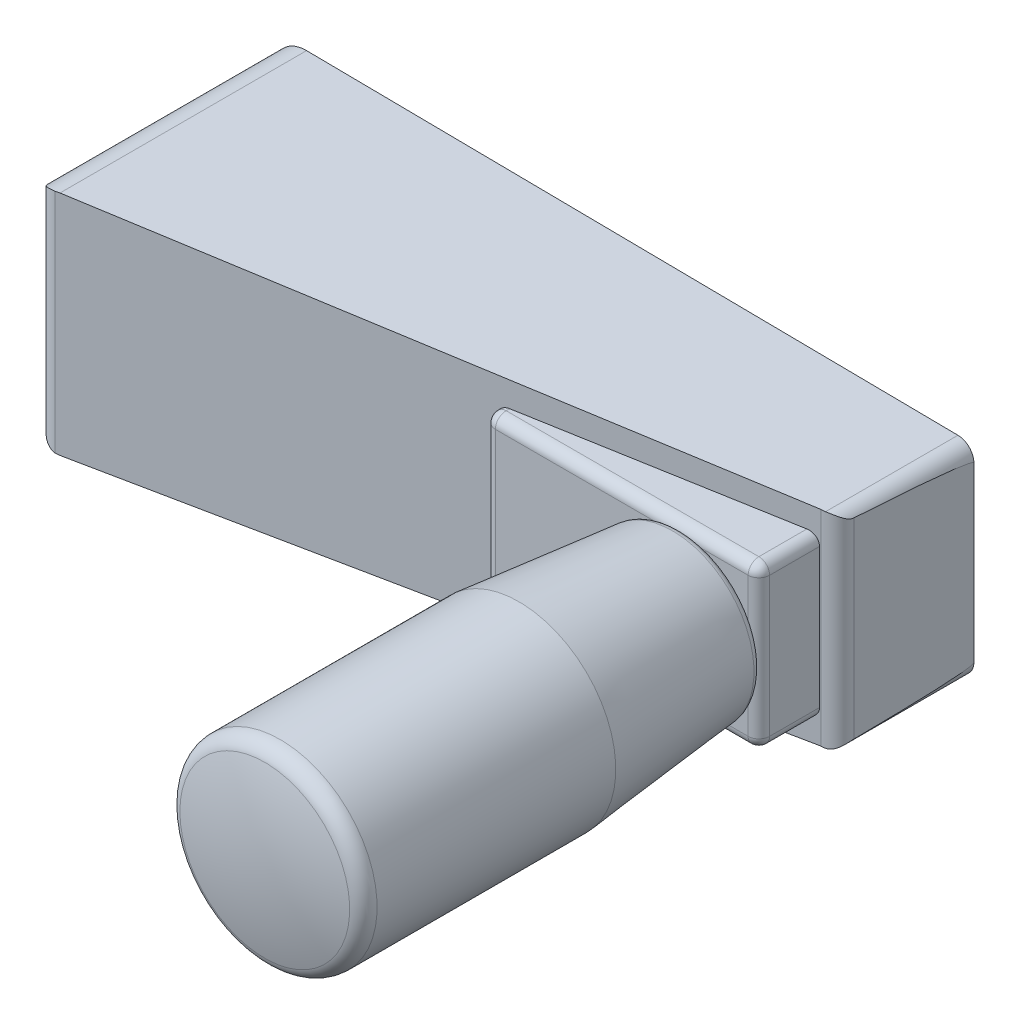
ISO-10303-21;
HEADER;
FILE_DESCRIPTION(('STEP AP214'),'2;1');
FILE_NAME('part.step','',(''),(''),'','','');
FILE_SCHEMA(('AUTOMOTIVE_DESIGN { 1 0 10303 214 1 1 1 1 }'));
ENDSEC;
DATA;
#1=APPLICATION_CONTEXT('core data for automotive mechanical design processes');
#2=APPLICATION_PROTOCOL_DEFINITION('international standard','automotive_design',2000,#1);
#3=PRODUCT_CONTEXT('',#1,'mechanical');
#4=PRODUCT('Part','Part','',(#3));
#5=PRODUCT_RELATED_PRODUCT_CATEGORY('part','',(#4));
#6=PRODUCT_DEFINITION_FORMATION('','',#4);
#7=PRODUCT_DEFINITION_CONTEXT('part definition',#1,'design');
#8=PRODUCT_DEFINITION('design','',#6,#7);
#9=PRODUCT_DEFINITION_SHAPE('','',#8);
#10=(LENGTH_UNIT() NAMED_UNIT(*) SI_UNIT(.MILLI.,.METRE.));
#11=(NAMED_UNIT(*) PLANE_ANGLE_UNIT() SI_UNIT($,.RADIAN.));
#12=(NAMED_UNIT(*) SI_UNIT($,.STERADIAN.) SOLID_ANGLE_UNIT());
#13=UNCERTAINTY_MEASURE_WITH_UNIT(LENGTH_MEASURE(1.E-05),#10,'distance_accuracy_value','');
#14=(GEOMETRIC_REPRESENTATION_CONTEXT(3) GLOBAL_UNCERTAINTY_ASSIGNED_CONTEXT((#13)) GLOBAL_UNIT_ASSIGNED_CONTEXT((#10,
#11,#12)) REPRESENTATION_CONTEXT('',''));
#15=CARTESIAN_POINT('',(0.,0.,0.));
#16=DIRECTION('',(0.,0.,1.));
#17=DIRECTION('',(1.,0.,0.));
#18=AXIS2_PLACEMENT_3D('',#15,#16,#17);
#19=CARTESIAN_POINT('',(6.5,0.,0.));
#20=DIRECTION('',(0.,0.,-1.));
#21=DIRECTION('',(0.,1.,0.));
#22=AXIS2_PLACEMENT_3D('',#19,#20,#21);
#23=PLANE('',#22);
#24=CARTESIAN_POINT('',(0.,0.,0.));
#25=DIRECTION('',(0.,0.,1.));
#26=DIRECTION('',(0.,-1.,0.));
#27=AXIS2_PLACEMENT_3D('',#24,#25,#26);
#28=CIRCLE('',#27,6.5);
#29=CARTESIAN_POINT('',(0.,-6.5,0.));
#30=VERTEX_POINT('',#29);
#31=EDGE_CURVE('E243',#30,#30,#28,.T.);
#32=ORIENTED_EDGE('',*,*,#31,.F.);
#33=EDGE_LOOP('',(#32));
#34=FACE_BOUND('',#33,.T.);
#35=CARTESIAN_POINT('',(0.,0.,0.));
#36=DIRECTION('',(0.,0.,-1.));
#37=DIRECTION('',(0.,1.,0.));
#38=AXIS2_PLACEMENT_3D('',#35,#36,#37);
#39=CIRCLE('',#38,4.5);
#40=CARTESIAN_POINT('',(0.,4.5,0.));
#41=VERTEX_POINT('',#40);
#42=EDGE_CURVE('E240',#41,#41,#39,.T.);
#43=ORIENTED_EDGE('',*,*,#42,.F.);
#44=EDGE_LOOP('',(#43));
#45=FACE_BOUND('',#44,.T.);
#46=ADVANCED_FACE('F14',(#34,#45),#23,.T.);
#47=CARTESIAN_POINT('',(30.1291258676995,-11.,13.8426788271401));
#48=DIRECTION('',(-0.173264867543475,0.,-0.984875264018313));
#49=DIRECTION('',(0.984875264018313,0.,-0.173264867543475));
#50=AXIS2_PLACEMENT_3D('',#47,#48,#49);
#51=PLANE('',#50);
#52=CARTESIAN_POINT('',(-30.,-7.9299705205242,24.4209372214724));
#53=DIRECTION('',(-0.173264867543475,0.,-0.984875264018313));
#54=DIRECTION('',(0.984875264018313,0.,-0.173264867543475));
#55=AXIS2_PLACEMENT_3D('',#52,#53,#54);
#56=ELLIPSE('',#55,3.04607101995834,3.);
#57=CARTESIAN_POINT('',(-29.9307876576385,-10.9291720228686,24.408760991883));
#58=VERTEX_POINT('',#57);
#59=CARTESIAN_POINT('',(-30.4494100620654,-10.8961179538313,24.5));
#60=VERTEX_POINT('',#59);
#61=EDGE_CURVE('E288',#58,#60,#56,.T.);
#62=ORIENTED_EDGE('',*,*,#61,.F.);
#63=DIRECTION('',(0.984620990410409,0.0227220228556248,-0.173220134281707));
#64=VECTOR('',#63,1.);
#65=CARTESIAN_POINT('',(30.0965329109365,-9.54392616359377,13.8484127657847));
#66=LINE('',#65,#64);
#67=CARTESIAN_POINT('',(30.1291258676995,-9.5431740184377,13.8426788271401));
#68=VERTEX_POINT('',#67);
#69=EDGE_CURVE('E168',#58,#68,#66,.T.);
#70=ORIENTED_EDGE('',*,*,#69,.T.);
#71=DIRECTION('',(0.,1.,0.));
#72=VECTOR('',#71,1.);
#73=CARTESIAN_POINT('',(30.1291258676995,-11.,13.8426788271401));
#74=LINE('',#73,#72);
#75=CARTESIAN_POINT('',(30.1291258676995,9.52133214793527,13.8426788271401));
#76=VERTEX_POINT('',#75);
#77=EDGE_CURVE('E782',#68,#76,#74,.T.);
#78=ORIENTED_EDGE('',*,*,#77,.T.);
#79=DIRECTION('',(0.984813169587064,-0.0112290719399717,-0.173253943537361));
#80=VECTOR('',#79,1.);
#81=CARTESIAN_POINT('',(30.3560617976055,9.51874457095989,13.8027549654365));
#82=LINE('',#81,#80);
#83=CARTESIAN_POINT('',(-30.0540268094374,10.2075546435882,24.4304419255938));
#84=VERTEX_POINT('',#83);
#85=EDGE_CURVE('E334',#84,#76,#82,.T.);
#86=ORIENTED_EDGE('',*,*,#85,.F.);
#87=CARTESIAN_POINT('',(-30.0882312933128,7.20774964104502,24.4364593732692));
#88=DIRECTION('',(-0.173264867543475,0.,-0.984875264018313));
#89=DIRECTION('',(0.984875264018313,0.,-0.173264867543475));
#90=AXIS2_PLACEMENT_3D('',#87,#88,#89);
#91=ELLIPSE('',#90,3.04607101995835,3.);
#92=CARTESIAN_POINT('',(-30.4494100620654,10.1859285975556,24.5));
#93=VERTEX_POINT('',#92);
#94=EDGE_CURVE('E810',#84,#93,#91,.F.);
#95=ORIENTED_EDGE('',*,*,#94,.T.);
#96=DIRECTION('',(0.,1.,0.));
#97=VECTOR('',#96,1.);
#98=CARTESIAN_POINT('',(-30.4494100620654,-11.,24.5));
#99=LINE('',#98,#97);
#100=EDGE_CURVE('E768',#60,#93,#99,.T.);
#101=ORIENTED_EDGE('',*,*,#100,.F.);
#102=EDGE_LOOP('',(#62,#70,#78,#86,#95,#101));
#103=FACE_BOUND('',#102,.T.);
#104=CARTESIAN_POINT('',(5.5,-6.485,18.1755749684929));
#105=DIRECTION('',(-0.173264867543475,0.,-0.984875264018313));
#106=DIRECTION('',(0.984875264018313,0.,-0.173264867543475));
#107=AXIS2_PLACEMENT_3D('',#104,#105,#106);
#108=ELLIPSE('',#107,1.01535700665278,1.);
#109=CARTESIAN_POINT('',(4.5,-6.485,18.3515006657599));
#110=VERTEX_POINT('',#109);
#111=CARTESIAN_POINT('',(5.5,-7.485,18.1755749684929));
#112=VERTEX_POINT('',#111);
#113=EDGE_CURVE('E154',#110,#112,#108,.F.);
#114=ORIENTED_EDGE('',*,*,#113,.F.);
#115=DIRECTION('',(0.,1.,0.));
#116=VECTOR('',#115,1.);
#117=CARTESIAN_POINT('',(4.5,-11.,18.3515006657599));
#118=LINE('',#117,#116);
#119=CARTESIAN_POINT('',(4.5,6.485,18.3515006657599));
#120=VERTEX_POINT('',#119);
#121=EDGE_CURVE('E162',#110,#120,#118,.T.);
#122=ORIENTED_EDGE('',*,*,#121,.T.);
#123=CARTESIAN_POINT('',(5.5,6.485,18.1755749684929));
#124=DIRECTION('',(-0.173264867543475,0.,-0.984875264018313));
#125=DIRECTION('',(0.984875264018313,0.,-0.173264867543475));
#126=AXIS2_PLACEMENT_3D('',#123,#124,#125);
#127=ELLIPSE('',#126,1.01535700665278,1.);
#128=CARTESIAN_POINT('',(5.5,7.485,18.1755749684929));
#129=VERTEX_POINT('',#128);
#130=EDGE_CURVE('E167',#129,#120,#127,.F.);
#131=ORIENTED_EDGE('',*,*,#130,.F.);
#132=DIRECTION('',(0.984875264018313,0.,-0.173264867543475));
#133=VECTOR('',#132,1.);
#134=CARTESIAN_POINT('',(30.1291258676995,7.485,13.8426788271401));
#135=LINE('',#134,#133);
#136=CARTESIAN_POINT('',(29.0072,7.485,14.0400544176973));
#137=VERTEX_POINT('',#136);
#138=EDGE_CURVE('E474',#129,#137,#135,.T.);
#139=ORIENTED_EDGE('',*,*,#138,.T.);
#140=CARTESIAN_POINT('',(29.0072,6.485,14.0400544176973));
#141=DIRECTION('',(-0.173264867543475,0.,-0.984875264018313));
#142=DIRECTION('',(0.984875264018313,0.,-0.173264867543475));
#143=AXIS2_PLACEMENT_3D('',#140,#141,#142);
#144=ELLIPSE('',#143,1.01535700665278,1.);
#145=CARTESIAN_POINT('',(30.0072,6.485,13.8641287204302));
#146=VERTEX_POINT('',#145);
#147=EDGE_CURVE('E472',#137,#146,#144,.T.);
#148=ORIENTED_EDGE('',*,*,#147,.T.);
#149=DIRECTION('',(0.,1.,0.));
#150=VECTOR('',#149,1.);
#151=CARTESIAN_POINT('',(30.0072,-11.,13.8641287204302));
#152=LINE('',#151,#150);
#153=CARTESIAN_POINT('',(30.0072,-6.485,13.8641287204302));
#154=VERTEX_POINT('',#153);
#155=EDGE_CURVE('E468',#154,#146,#152,.T.);
#156=ORIENTED_EDGE('',*,*,#155,.F.);
#157=CARTESIAN_POINT('',(29.0072,-6.485,14.0400544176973));
#158=DIRECTION('',(-0.173264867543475,0.,-0.984875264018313));
#159=DIRECTION('',(0.984875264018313,0.,-0.173264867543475));
#160=AXIS2_PLACEMENT_3D('',#157,#158,#159);
#161=ELLIPSE('',#160,1.01535700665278,1.);
#162=CARTESIAN_POINT('',(29.0072,-7.485,14.0400544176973));
#163=VERTEX_POINT('',#162);
#164=EDGE_CURVE('E179',#154,#163,#161,.T.);
#165=ORIENTED_EDGE('',*,*,#164,.T.);
#166=DIRECTION('',(0.984875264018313,0.,-0.173264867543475));
#167=VECTOR('',#166,1.);
#168=CARTESIAN_POINT('',(30.1291258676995,-7.485,13.8426788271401));
#169=LINE('',#168,#167);
#170=EDGE_CURVE('E173',#112,#163,#169,.T.);
#171=ORIENTED_EDGE('',*,*,#170,.F.);
#172=EDGE_LOOP('',(#114,#122,#131,#139,#148,#156,#165,#171));
#173=FACE_BOUND('',#172,.T.);
#174=ADVANCED_FACE('F170',(#103,#173),#51,.F.);
#175=CARTESIAN_POINT('',(32.,-11.,1.5));
#176=DIRECTION('',(-0.999657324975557,0.,-0.0261769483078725));
#177=DIRECTION('',(0.0261769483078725,0.,-0.999657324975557));
#178=AXIS2_PLACEMENT_3D('',#175,#176,#177);
#179=PLANE('',#178);
#180=CARTESIAN_POINT('',(30.5,-8.03421602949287,58.7826889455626));
#181=DIRECTION('',(-0.999657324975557,0.,-0.0261769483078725));
#182=DIRECTION('',(0.0261769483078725,0.,-0.999657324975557));
#183=AXIS2_PLACEMENT_3D('',#180,#181,#182);
#184=ELLIPSE('',#183,57.3023250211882,1.5);
#185=CARTESIAN_POINT('',(32.,-8.03421602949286,1.5));
#186=VERTEX_POINT('',#185);
#187=CARTESIAN_POINT('',(31.715244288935,-8.9135233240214,12.3743818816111));
#188=VERTEX_POINT('',#187);
#189=EDGE_CURVE('E302',#186,#188,#184,.T.);
#190=ORIENTED_EDGE('',*,*,#189,.F.);
#191=DIRECTION('',(0.,1.,0.));
#192=VECTOR('',#191,1.);
#193=CARTESIAN_POINT('',(32.,-11.,1.5));
#194=LINE('',#193,#192);
#195=CARTESIAN_POINT('',(32.,8.03421602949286,1.5));
#196=VERTEX_POINT('',#195);
#197=EDGE_CURVE('E792',#186,#196,#194,.T.);
#198=ORIENTED_EDGE('',*,*,#197,.T.);
#199=CARTESIAN_POINT('',(30.5000987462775,8.01700472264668,58.7789179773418));
#200=DIRECTION('',(-0.999657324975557,0.,-0.0261769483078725));
#201=DIRECTION('',(0.0261769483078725,0.,-0.999657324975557));
#202=AXIS2_PLACEMENT_3D('',#199,#200,#201);
#203=ELLIPSE('',#202,57.302325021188,1.5);
#204=CARTESIAN_POINT('',(31.715244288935,8.89644847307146,12.3743818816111));
#205=VERTEX_POINT('',#204);
#206=EDGE_CURVE('E780',#205,#196,#203,.T.);
#207=ORIENTED_EDGE('',*,*,#206,.F.);
#208=DIRECTION('',(0.,1.,0.));
#209=VECTOR('',#208,1.);
#210=CARTESIAN_POINT('',(31.715244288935,-11.,12.3743818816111));
#211=LINE('',#210,#209);
#212=EDGE_CURVE('E790',#188,#205,#211,.T.);
#213=ORIENTED_EDGE('',*,*,#212,.F.);
#214=EDGE_LOOP('',(#190,#198,#207,#213));
#215=FACE_BOUND('',#214,.T.);
#216=ADVANCED_FACE('F694',(#215),#179,.F.);
#217=CARTESIAN_POINT('',(30.215528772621,-11.,12.3451693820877));
#218=DIRECTION('',(0.,1.,0.));
#219=DIRECTION('',(-1.,0.,0.));
#220=AXIS2_PLACEMENT_3D('',#217,#218,#219);
#221=CYLINDRICAL_SURFACE('',#220,1.5);
#222=CARTESIAN_POINT('',(31.715528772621,-8.91313002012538,12.3451693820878));
#223=CARTESIAN_POINT('',(31.7155273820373,-8.91313366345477,12.4013941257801));
#224=CARTESIAN_POINT('',(31.7123354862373,-8.91759637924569,12.4576265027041));
#225=CARTESIAN_POINT('',(31.6998956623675,-8.93441097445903,12.5682775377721));
#226=CARTESIAN_POINT('',(31.6906296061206,-8.94678646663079,12.6226902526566));
#227=CARTESIAN_POINT('',(31.6620326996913,-8.98310455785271,12.7493247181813));
#228=CARTESIAN_POINT('',(31.6401831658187,-9.00967788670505,12.8201915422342));
#229=CARTESIAN_POINT('',(31.587433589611,-9.06816294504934,12.9560830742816));
#230=CARTESIAN_POINT('',(31.5565129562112,-9.10008674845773,13.0210940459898));
#231=CARTESIAN_POINT('',(31.4842016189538,-9.16732051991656,13.1490101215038));
#232=CARTESIAN_POINT('',(31.4423184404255,-9.20271990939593,13.2115892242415));
#233=CARTESIAN_POINT('',(31.3492409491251,-9.27201947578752,13.3302438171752));
#234=CARTESIAN_POINT('',(31.298056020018,-9.30592112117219,13.3863257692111));
#235=CARTESIAN_POINT('',(31.1898041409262,-9.36756131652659,13.4879511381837));
#236=CARTESIAN_POINT('',(31.133294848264,-9.39555105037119,13.5339312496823));
#237=CARTESIAN_POINT('',(31.012353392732,-9.44551335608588,13.6181505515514));
#238=CARTESIAN_POINT('',(30.9479294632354,-9.46749210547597,13.6563976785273));
#239=CARTESIAN_POINT('',(30.8239888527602,-9.49995538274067,13.7176447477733));
#240=CARTESIAN_POINT('',(30.7655655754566,-9.51177376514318,13.7421393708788));
#241=CARTESIAN_POINT('',(30.6451821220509,-9.5284063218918,13.7837253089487));
#242=CARTESIAN_POINT('',(30.5832245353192,-9.53322555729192,13.8008219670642));
#243=CARTESIAN_POINT('',(30.4572320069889,-9.53493370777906,13.8269702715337));
#244=CARTESIAN_POINT('',(30.39318950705,-9.53178960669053,13.8359882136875));
#245=CARTESIAN_POINT('',(30.2654292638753,-9.51715563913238,13.8457074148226));
#246=CARTESIAN_POINT('',(30.201711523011,-9.50566571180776,13.8464086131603));
#247=CARTESIAN_POINT('',(30.0807800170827,-9.47570273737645,13.8402518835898));
#248=CARTESIAN_POINT('',(30.0234130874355,-9.45773396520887,13.8338839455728));
#249=CARTESIAN_POINT('',(29.9120917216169,-9.41548863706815,13.8152429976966));
#250=CARTESIAN_POINT('',(29.8581383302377,-9.39121016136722,13.802968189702));
#251=CARTESIAN_POINT('',(29.7368249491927,-9.32793250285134,13.7685649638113));
#252=CARTESIAN_POINT('',(29.6711587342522,-9.28673603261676,13.744504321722));
#253=CARTESIAN_POINT('',(29.5484062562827,-9.19624593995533,13.6903354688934));
#254=CARTESIAN_POINT('',(29.4913401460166,-9.14693384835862,13.6602134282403));
#255=CARTESIAN_POINT('',(29.3732795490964,-9.02874381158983,13.5887370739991));
#256=CARTESIAN_POINT('',(29.3147125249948,-8.95802548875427,13.546433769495));
#257=CARTESIAN_POINT('',(29.2113391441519,-8.80733899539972,13.4614365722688));
#258=CARTESIAN_POINT('',(29.1665325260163,-8.72737100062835,13.4187426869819));
#259=CARTESIAN_POINT('',(29.1047140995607,-8.58805638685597,13.3538012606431));
#260=CARTESIAN_POINT('',(29.0834806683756,-8.53145614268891,13.3296727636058));
#261=CARTESIAN_POINT('',(29.0476577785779,-8.41426348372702,13.286898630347));
#262=CARTESIAN_POINT('',(29.0330492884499,-8.35368308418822,13.2682373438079));
#263=CARTESIAN_POINT('',(29.0135679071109,-8.24171807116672,13.2426656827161));
#264=CARTESIAN_POINT('',(29.0073225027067,-8.19095586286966,13.2341408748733));
#265=CARTESIAN_POINT('',(29.0001009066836,-8.08839175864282,13.2242469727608));
#266=CARTESIAN_POINT('',(28.9991170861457,-8.03659147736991,13.2228675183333));
#267=CARTESIAN_POINT('',(29.0024930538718,-7.93356421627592,13.2275238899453));
#268=CARTESIAN_POINT('',(29.0068487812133,-7.88233683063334,13.2335540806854));
#269=CARTESIAN_POINT('',(29.0205374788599,-7.78166031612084,13.2518792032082));
#270=CARTESIAN_POINT('',(29.0298815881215,-7.73221543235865,13.2641881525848));
#271=CARTESIAN_POINT('',(29.0594073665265,-7.60922694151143,13.301307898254));
#272=CARTESIAN_POINT('',(29.0827235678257,-7.53741183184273,13.3292703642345));
#273=CARTESIAN_POINT('',(29.1387135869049,-7.3998311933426,13.3902499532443));
#274=CARTESIAN_POINT('',(29.1714122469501,-7.33408234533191,13.4232803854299));
#275=CARTESIAN_POINT('',(29.2478651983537,-7.20468009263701,13.4925359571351));
#276=CARTESIAN_POINT('',(29.2921635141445,-7.14138687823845,13.528834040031));
#277=CARTESIAN_POINT('',(29.3905523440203,-7.02173832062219,13.5993934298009));
#278=CARTESIAN_POINT('',(29.4446305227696,-6.96537438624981,13.6336572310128));
#279=CARTESIAN_POINT('',(29.5563455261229,-6.86610139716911,13.6938990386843));
#280=CARTESIAN_POINT('',(29.6130056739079,-6.82240026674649,13.7203697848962));
#281=CARTESIAN_POINT('',(29.7337944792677,-6.74264802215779,13.7671793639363));
#282=CARTESIAN_POINT('',(29.79791522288,-6.70658891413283,13.7875246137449));
#283=CARTESIAN_POINT('',(29.9215294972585,-6.64885125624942,13.8172153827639));
#284=CARTESIAN_POINT('',(29.9800694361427,-6.62578605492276,13.8278144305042));
#285=CARTESIAN_POINT('',(30.1003709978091,-6.58705320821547,13.8419651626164));
#286=CARTESIAN_POINT('',(30.1621304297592,-6.57138060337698,13.8455215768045));
#287=CARTESIAN_POINT('',(30.287340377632,-6.54799776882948,13.8447606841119));
#288=CARTESIAN_POINT('',(30.3507961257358,-6.54031604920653,13.84041533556));
#289=CARTESIAN_POINT('',(30.4770800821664,-6.53305784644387,13.8235634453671));
#290=CARTESIAN_POINT('',(30.5399082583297,-6.53348177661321,13.8110564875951));
#291=CARTESIAN_POINT('',(30.6595920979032,-6.54158925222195,13.7791972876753));
#292=CARTESIAN_POINT('',(30.7165866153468,-6.54887561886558,13.7602555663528));
#293=CARTESIAN_POINT('',(30.827013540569,-6.56921766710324,13.7161644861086));
#294=CARTESIAN_POINT('',(30.8804442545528,-6.58227606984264,13.6910122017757));
#295=CARTESIAN_POINT('',(31.0014797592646,-6.61865150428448,13.6252414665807));
#296=CARTESIAN_POINT('',(31.06723103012,-6.64397036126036,13.5823183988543));
#297=CARTESIAN_POINT('',(31.1897730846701,-6.70050488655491,13.4883395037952));
#298=CARTESIAN_POINT('',(31.2465487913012,-6.73173028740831,13.4372702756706));
#299=CARTESIAN_POINT('',(31.3517999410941,-6.79794571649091,13.3273998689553));
#300=CARTESIAN_POINT('',(31.4001163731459,-6.83299111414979,13.2684811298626));
#301=CARTESIAN_POINT('',(31.4872577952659,-6.90352783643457,13.1442131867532));
#302=CARTESIAN_POINT('',(31.5260810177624,-6.93901924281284,13.078862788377));
#303=CARTESIAN_POINT('',(31.588249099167,-7.00111010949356,12.9531959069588));
#304=CARTESIAN_POINT('',(31.613097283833,-7.02820329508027,12.8938692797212));
#305=CARTESIAN_POINT('',(31.6554106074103,-7.07710066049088,12.7705719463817));
#306=CARTESIAN_POINT('',(31.6728918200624,-7.09891631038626,12.7066117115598));
#307=CARTESIAN_POINT('',(31.6961545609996,-7.1289605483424,12.5907699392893));
#308=CARTESIAN_POINT('',(31.7037581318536,-7.13921302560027,12.5397990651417));
#309=CARTESIAN_POINT('',(31.7136424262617,-7.15265647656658,12.4364688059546));
#310=CARTESIAN_POINT('',(31.7159340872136,-7.15586195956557,12.3841124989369));
#311=CARTESIAN_POINT('',(31.7150041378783,-7.15457711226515,12.2794696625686));
#312=CARTESIAN_POINT('',(31.7117740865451,-7.15007499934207,12.2271833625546));
#313=CARTESIAN_POINT('',(31.700075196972,-7.13426541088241,12.1242149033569));
#314=CARTESIAN_POINT('',(31.691595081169,-7.12294328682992,12.0735364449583));
#315=CARTESIAN_POINT('',(31.6648679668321,-7.08884089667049,11.9515448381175));
#316=CARTESIAN_POINT('',(31.6439086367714,-7.06317861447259,11.8816566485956));
#317=CARTESIAN_POINT('',(31.5931804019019,-7.00639560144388,11.7474623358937));
#318=CARTESIAN_POINT('',(31.5633809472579,-6.97525609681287,11.683176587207));
#319=CARTESIAN_POINT('',(31.4853652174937,-6.90163887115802,11.5415038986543));
#320=CARTESIAN_POINT('',(31.4343056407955,-6.85856513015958,11.465982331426));
#321=CARTESIAN_POINT('',(31.3185596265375,-6.77522869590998,11.324564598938));
#322=CARTESIAN_POINT('',(31.2538981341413,-6.73496103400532,11.2586511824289));
#323=CARTESIAN_POINT('',(31.1294710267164,-6.67138276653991,11.1537362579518));
#324=CARTESIAN_POINT('',(31.0727363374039,-6.64637627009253,11.1121764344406));
#325=CARTESIAN_POINT('',(30.9522481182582,-6.60258652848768,11.0366279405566));
#326=CARTESIAN_POINT('',(30.888504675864,-6.58379449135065,11.0026285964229));
#327=CARTESIAN_POINT('',(30.7652900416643,-6.55672710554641,10.9481780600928));
#328=CARTESIAN_POINT('',(30.7066414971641,-6.5472876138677,10.926453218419));
#329=CARTESIAN_POINT('',(30.586417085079,-6.53549264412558,10.8903939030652));
#330=CARTESIAN_POINT('',(30.5248428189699,-6.53313333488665,10.876055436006));
#331=CARTESIAN_POINT('',(30.4003672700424,-6.5362311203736,10.8552609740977));
#332=CARTESIAN_POINT('',(30.3374626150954,-6.54171123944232,10.8488283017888));
#333=CARTESIAN_POINT('',(30.2125573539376,-6.560659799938,10.8438700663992));
#334=CARTESIAN_POINT('',(30.1505568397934,-6.5741290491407,10.8453453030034));
#335=CARTESIAN_POINT('',(30.0320106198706,-6.60781530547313,10.8553012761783));
#336=CARTESIAN_POINT('',(29.9753449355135,-6.62770939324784,10.8634709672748));
#337=CARTESIAN_POINT('',(29.8657291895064,-6.67361391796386,10.8854532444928));
#338=CARTESIAN_POINT('',(29.8127809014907,-6.69962724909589,10.8992685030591));
#339=CARTESIAN_POINT('',(29.6920439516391,-6.76785497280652,10.9375636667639));
#340=CARTESIAN_POINT('',(29.6262629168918,-6.8124692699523,10.964101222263));
#341=CARTESIAN_POINT('',(29.5039864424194,-6.90989530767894,11.0229251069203));
#342=CARTESIAN_POINT('',(29.4475079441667,-6.96272167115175,11.0552217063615));
#343=CARTESIAN_POINT('',(29.3431165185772,-7.07626176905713,11.1233486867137));
#344=CARTESIAN_POINT('',(29.2953740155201,-7.13709919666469,11.1592317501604));
#345=CARTESIAN_POINT('',(29.2097150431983,-7.26537386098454,11.2309667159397));
#346=CARTESIAN_POINT('',(29.1717977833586,-7.33281056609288,11.266818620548));
#347=CARTESIAN_POINT('',(29.1132929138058,-7.45908172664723,11.3271116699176));
#348=CARTESIAN_POINT('',(29.0907308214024,-7.51662033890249,11.3523433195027));
#349=CARTESIAN_POINT('',(29.0524913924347,-7.63594014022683,11.3974260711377));
#350=CARTESIAN_POINT('',(29.036798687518,-7.6977114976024,11.4172891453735));
#351=CARTESIAN_POINT('',(29.0158343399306,-7.81105010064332,11.4446319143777));
#352=CARTESIAN_POINT('',(29.009033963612,-7.86189341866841,11.4538700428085));
#353=CARTESIAN_POINT('',(29.0007247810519,-7.96475925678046,11.4652228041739));
#354=CARTESIAN_POINT('',(28.999206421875,-8.01677947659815,11.4673502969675));
#355=CARTESIAN_POINT('',(29.0015825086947,-8.12044910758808,11.4640699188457));
#356=CARTESIAN_POINT('',(29.0054778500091,-8.17209845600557,11.4586608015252));
#357=CARTESIAN_POINT('',(29.0183500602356,-8.27369250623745,11.4413580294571));
#358=CARTESIAN_POINT('',(29.0273387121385,-8.32363296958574,11.4294493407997));
#359=CARTESIAN_POINT('',(29.0556942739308,-8.44620949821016,11.3935758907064));
#360=CARTESIAN_POINT('',(29.0780237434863,-8.51724214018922,11.3665611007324));
#361=CARTESIAN_POINT('',(29.1318021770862,-8.65342797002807,11.3073129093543));
#362=CARTESIAN_POINT('',(29.1632748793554,-8.71856526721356,11.2750660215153));
#363=CARTESIAN_POINT('',(29.2369489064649,-8.84692439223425,11.2071686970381));
#364=CARTESIAN_POINT('',(29.2796827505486,-8.90979384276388,11.171430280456));
#365=CARTESIAN_POINT('',(29.3746362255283,-9.02887364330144,11.1016372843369));
#366=CARTESIAN_POINT('',(29.4268453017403,-9.08509128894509,11.0675808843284));
#367=CARTESIAN_POINT('',(29.5363269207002,-9.18592323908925,11.0063982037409));
#368=CARTESIAN_POINT('',(29.5928897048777,-9.23109996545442,10.9789389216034));
#369=CARTESIAN_POINT('',(29.7137778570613,-9.31374588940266,10.9300787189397));
#370=CARTESIAN_POINT('',(29.7780950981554,-9.3512230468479,10.9086715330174));
#371=CARTESIAN_POINT('',(29.9019200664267,-9.41124009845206,10.8771748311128));
#372=CARTESIAN_POINT('',(29.9603844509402,-9.43523651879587,10.8657794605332));
#373=CARTESIAN_POINT('',(30.0807409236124,-9.47582802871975,10.8500084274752));
#374=CARTESIAN_POINT('',(30.1426305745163,-9.49242830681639,10.8456278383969));
#375=CARTESIAN_POINT('',(30.2683530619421,-9.51761211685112,10.8447780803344));
#376=CARTESIAN_POINT('',(30.3321926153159,-9.52616368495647,10.8483402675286));
#377=CARTESIAN_POINT('',(30.4594391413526,-9.53502340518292,10.8637462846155));
#378=CARTESIAN_POINT('',(30.5228461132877,-9.53533154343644,10.8755901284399));
#379=CARTESIAN_POINT('',(30.6433361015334,-9.52849654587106,10.9062083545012));
#380=CARTESIAN_POINT('',(30.7005680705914,-9.52181124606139,10.924510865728));
#381=CARTESIAN_POINT('',(30.8115743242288,-9.50258261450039,10.9673898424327));
#382=CARTESIAN_POINT('',(30.8653469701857,-9.49003652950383,10.9919692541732));
#383=CARTESIAN_POINT('',(30.9865838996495,-9.4549493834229,11.0561108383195));
#384=CARTESIAN_POINT('',(31.0522976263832,-9.43044928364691,11.0979100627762));
#385=CARTESIAN_POINT('',(31.1749826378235,-9.37546030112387,11.1896003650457));
#386=CARTESIAN_POINT('',(31.2319399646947,-9.34496202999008,11.2395041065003));
#387=CARTESIAN_POINT('',(31.3377265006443,-9.28005918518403,11.3469445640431));
#388=CARTESIAN_POINT('',(31.3864044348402,-9.2455979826,11.404594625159));
#389=CARTESIAN_POINT('',(31.4744839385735,-9.17593723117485,11.5262208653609));
#390=CARTESIAN_POINT('',(31.5138824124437,-9.14073744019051,11.5901991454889));
#391=CARTESIAN_POINT('',(31.5785828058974,-9.07749240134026,11.7155790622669));
#392=CARTESIAN_POINT('',(31.605058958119,-9.04911605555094,11.7762061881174));
#393=CARTESIAN_POINT('',(31.6502497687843,-8.99759367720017,11.9023987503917));
#394=CARTESIAN_POINT('',(31.6689807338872,-8.97443670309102,11.9679534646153));
#395=CARTESIAN_POINT('',(31.6937693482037,-8.94262863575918,12.0855780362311));
#396=CARTESIAN_POINT('',(31.7018730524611,-8.93175724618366,12.1365942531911));
#397=CARTESIAN_POINT('',(31.7127471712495,-8.91701442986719,12.2401304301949));
#398=CARTESIAN_POINT('',(31.7155300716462,-8.91312661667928,12.2926465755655));
#399=CARTESIAN_POINT('',(31.715528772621,-8.91313002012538,12.3451693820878));
#400=B_SPLINE_CURVE_WITH_KNOTS('',3,(#222,#223,#224,#225,#226,#227,#228,#229,#230,#231,#232,
#233,#234,#235,#236,#237,#238,#239,#240,#241,#242,#243,#244,#245,#246,#247,#248,#249,#250,#251,
#252,#253,#254,#255,#256,#257,#258,#259,#260,#261,#262,#263,#264,#265,#266,#267,#268,#269,#270,
#271,#272,#273,#274,#275,#276,#277,#278,#279,#280,#281,#282,#283,#284,#285,#286,#287,#288,#289,
#290,#291,#292,#293,#294,#295,#296,#297,#298,#299,#300,#301,#302,#303,#304,#305,#306,#307,#308,
#309,#310,#311,#312,#313,#314,#315,#316,#317,#318,#319,#320,#321,#322,#323,#324,#325,#326,#327,
#328,#329,#330,#331,#332,#333,#334,#335,#336,#337,#338,#339,#340,#341,#342,#343,#344,#345,#346,
#347,#348,#349,#350,#351,#352,#353,#354,#355,#356,#357,#358,#359,#360,#361,#362,#363,#364,#365,
#366,#367,#368,#369,#370,#371,#372,#373,#374,#375,#376,#377,#378,#379,#380,#381,#382,#383,#384,
#385,#386,#387,#388,#389,#390,#391,#392,#393,#394,#395,#396,#397,#398,#399),.UNSPECIFIED.,.T.,
.F.,(4,2,2,2,2,2,2,2,2,2,2,2,2,2,2,2,2,2,2,2,2,2,2,2,2,2,2,2,2,2,2,2,2,2,2,2,2,2,2,2,2,2,2,2,2,
2,2,2,2,2,2,2,2,2,2,2,2,2,2,2,2,2,2,2,2,2,2,2,2,2,2,2,2,2,2,2,2,2,2,2,2,2,2,2,2,2,2,2,4),(0.,
0.168454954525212,0.337414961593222,0.572435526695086,0.807993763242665,1.05684828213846,
1.30545313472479,1.5387214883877,1.77174920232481,1.96427315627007,2.15665782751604,
2.34984143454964,2.54302645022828,2.72361281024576,2.90425417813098,3.14642986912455,
3.38916451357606,3.69100956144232,3.99284887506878,4.18762715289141,4.38184228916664,
4.53672408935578,4.69138126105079,4.84592088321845,5.00080704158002,5.24101190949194,
5.48185873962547,5.73710245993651,5.99202645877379,6.2200672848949,6.44786838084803,
6.6384791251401,6.82896181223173,7.02012180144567,7.21129153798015,7.39203544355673,
7.57286464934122,7.81902664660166,8.06559784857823,8.31639684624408,8.56724250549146,
8.77607822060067,8.98445589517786,9.14145032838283,9.29812121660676,9.4550318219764,
9.61228065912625,9.84301735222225,10.0745609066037,10.3756584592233,10.6762085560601,
10.8993230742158,11.1221205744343,11.3110631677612,11.4999035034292,11.6892996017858,
11.8787148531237,12.059797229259,12.2409654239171,12.4909863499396,12.7414576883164,
12.9963888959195,13.2512995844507,13.451055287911,13.6503617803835,13.8060673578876,
13.9614911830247,14.1169407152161,14.2727513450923,14.509054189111,14.7459761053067,
14.9971851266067,15.2481160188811,15.4795281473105,15.7106998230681,15.9025426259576,
16.0942506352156,16.2867168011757,16.4791832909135,16.6597936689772,16.8404889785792,
17.0840903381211,17.3280760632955,17.5761278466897,17.8242622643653,18.0396451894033,
18.2545723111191,18.4123064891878,18.5696700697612),.UNSPECIFIED.);
#401=CARTESIAN_POINT('',(30.534606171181,-9.53381678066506,13.8108397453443));
#402=VERTEX_POINT('',#401);
#403=EDGE_CURVE('E295',#188,#402,#400,.T.);
#404=ORIENTED_EDGE('',*,*,#403,.F.);
#405=ORIENTED_EDGE('',*,*,#212,.T.);
#406=CARTESIAN_POINT('',(30.1291258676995,9.47040732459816,13.8426788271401));
#407=CARTESIAN_POINT('',(30.159657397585,9.47820315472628,13.8444429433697));
#408=CARTESIAN_POINT('',(30.1904749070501,9.48504035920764,13.8452804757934));
#409=CARTESIAN_POINT('',(30.2524697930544,9.4967596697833,13.845034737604));
#410=CARTESIAN_POINT('',(30.2836471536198,9.50164186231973,13.8439515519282));
#411=CARTESIAN_POINT('',(30.3770325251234,9.51325375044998,13.8377443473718));
#412=CARTESIAN_POINT('',(30.4394627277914,9.51704241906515,13.8296851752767));
#413=CARTESIAN_POINT('',(30.5627829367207,9.51696632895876,13.8057756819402));
#414=CARTESIAN_POINT('',(30.6236721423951,9.51309767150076,13.7899213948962));
#415=CARTESIAN_POINT('',(30.7422641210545,9.4985341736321,13.7510316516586));
#416=CARTESIAN_POINT('',(30.7999646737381,9.48783464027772,13.7279912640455));
#417=CARTESIAN_POINT('',(30.9120900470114,9.46049475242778,13.6751040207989));
#418=CARTESIAN_POINT('',(30.9664254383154,9.44373903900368,13.6451293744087));
#419=CARTESIAN_POINT('',(31.0698656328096,9.4056762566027,13.5796176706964));
#420=CARTESIAN_POINT('',(31.118967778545,9.38436689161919,13.5440778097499));
#421=CARTESIAN_POINT('',(31.2349164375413,9.32699222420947,13.4492247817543));
#422=CARTESIAN_POINT('',(31.2983185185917,9.28888489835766,13.3869253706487));
#423=CARTESIAN_POINT('',(31.4126873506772,9.2094976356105,13.2532431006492));
#424=CARTESIAN_POINT('',(31.4636094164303,9.16820697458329,13.1818289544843));
#425=CARTESIAN_POINT('',(31.5452367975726,9.09412744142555,13.0431825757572));
#426=CARTESIAN_POINT('',(31.577897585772,9.06106940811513,12.9772402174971));
#427=CARTESIAN_POINT('',(31.6336220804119,9.00026696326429,12.8396112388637));
#428=CARTESIAN_POINT('',(31.6567581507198,8.97248338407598,12.7679730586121));
#429=CARTESIAN_POINT('',(31.6866391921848,8.93488866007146,12.6427110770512));
#430=CARTESIAN_POINT('',(31.6962619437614,8.92217119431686,12.5906900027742));
#431=CARTESIAN_POINT('',(31.7065925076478,8.90829937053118,12.5108858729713));
#432=CARTESIAN_POINT('',(31.709356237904,8.90453595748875,12.4838133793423));
#433=CARTESIAN_POINT('',(31.713417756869,8.89897146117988,12.4293093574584));
#434=CARTESIAN_POINT('',(31.7147128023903,8.89717405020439,12.4018772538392));
#435=CARTESIAN_POINT('',(31.715244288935,8.89644847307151,12.3743818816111));
#436=B_SPLINE_CURVE_WITH_KNOTS('',3,(#406,#407,#408,#409,#410,#411,#412,#413,#414,#415,#416,
#417,#418,#419,#420,#421,#422,#423,#424,#425,#426,#427,#428,#429,#430,#431,#432,#433,#434,#435),
.UNSPECIFIED.,.F.,.F.,(4,2,2,2,2,2,2,2,2,2,2,2,2,2,4),(0.,0.0946261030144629,0.189248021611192,
0.377364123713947,0.565576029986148,0.753917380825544,0.94605366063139,1.13828704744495,
1.42688844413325,1.71650857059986,1.95781245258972,2.19724760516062,2.35979265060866,
2.44210556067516,2.52457196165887),.UNSPECIFIED.);
#437=CARTESIAN_POINT('',(30.5172009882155,9.51690722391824,13.8145208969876));
#438=VERTEX_POINT('',#437);
#439=EDGE_CURVE('E325',#438,#205,#436,.T.);
#440=ORIENTED_EDGE('',*,*,#439,.F.);
#441=CARTESIAN_POINT('',(30.215528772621,9.52034696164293,12.3451693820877));
#442=DIRECTION('',(0.0114014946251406,0.999935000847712,0.));
#443=DIRECTION('',(-0.999935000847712,0.0114014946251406,0.));
#444=AXIS2_PLACEMENT_3D('',#441,#442,#443);
#445=ELLIPSE('',#444,1.50009750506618,1.5);
#446=EDGE_CURVE('E785',#76,#438,#445,.T.);
#447=ORIENTED_EDGE('',*,*,#446,.F.);
#448=ORIENTED_EDGE('',*,*,#77,.F.);
#449=CARTESIAN_POINT('',(30.215528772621,-9.5411801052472,12.3451693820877));
#450=DIRECTION('',(-0.0230707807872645,0.999733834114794,0.));
#451=DIRECTION('',(0.999733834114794,0.0230707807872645,0.));
#452=AXIS2_PLACEMENT_3D('',#449,#450,#451);
#453=ELLIPSE('',#452,1.50039935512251,1.5);
#454=EDGE_CURVE('E292',#68,#402,#453,.T.);
#455=ORIENTED_EDGE('',*,*,#454,.T.);
#456=EDGE_LOOP('',(#404,#405,#440,#447,#448,#455));
#457=FACE_BOUND('',#456,.T.);
#458=ADVANCED_FACE('F304',(#457),#221,.T.);
#459=CARTESIAN_POINT('',(-32.4487247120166,-11.,22.5523538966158));
#460=DIRECTION('',(0.999657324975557,0.,-0.0261769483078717));
#461=DIRECTION('',(0.0261769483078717,0.,0.999657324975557));
#462=AXIS2_PLACEMENT_3D('',#459,#460,#461);
#463=PLANE('',#462);
#464=CARTESIAN_POINT('',(-30.,-7.9299705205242,116.065377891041));
#465=DIRECTION('',(0.999657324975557,0.,-0.0261769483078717));
#466=DIRECTION('',(-0.0261769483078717,0.,-0.999657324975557));
#467=AXIS2_PLACEMENT_3D('',#464,#465,#466);
#468=ELLIPSE('',#467,114.604650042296,3.);
#469=CARTESIAN_POINT('',(-32.4487247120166,-9.66310273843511,22.5523538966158));
#470=VERTEX_POINT('',#469);
#471=CARTESIAN_POINT('',(-33.,-7.92997052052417,1.5));
#472=VERTEX_POINT('',#471);
#473=EDGE_CURVE('E290',#470,#472,#468,.T.);
#474=ORIENTED_EDGE('',*,*,#473,.F.);
#475=DIRECTION('',(0.,1.,0.));
#476=VECTOR('',#475,1.);
#477=CARTESIAN_POINT('',(-32.4487247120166,-11.,22.5523538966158));
#478=LINE('',#477,#476);
#479=CARTESIAN_POINT('',(-32.4487247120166,9.05925465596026,22.5523538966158));
#480=VERTEX_POINT('',#479);
#481=EDGE_CURVE('E776',#470,#480,#478,.T.);
#482=ORIENTED_EDGE('',*,*,#481,.T.);
#483=CARTESIAN_POINT('',(-30.0882312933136,7.20774964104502,112.695960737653));
#484=DIRECTION('',(0.999657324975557,0.,-0.0261769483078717));
#485=DIRECTION('',(-0.0261769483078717,0.,-0.999657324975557));
#486=AXIS2_PLACEMENT_3D('',#483,#484,#485);
#487=ELLIPSE('',#486,114.604650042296,3.);
#488=CARTESIAN_POINT('',(-33.,7.92997052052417,1.5));
#489=VERTEX_POINT('',#488);
#490=EDGE_CURVE('E809',#480,#489,#487,.F.);
#491=ORIENTED_EDGE('',*,*,#490,.T.);
#492=DIRECTION('',(0.,1.,0.));
#493=VECTOR('',#492,1.);
#494=CARTESIAN_POINT('',(-33.,-11.,1.5));
#495=LINE('',#494,#493);
#496=EDGE_CURVE('E794',#472,#489,#495,.T.);
#497=ORIENTED_EDGE('',*,*,#496,.F.);
#498=EDGE_LOOP('',(#474,#482,#491,#497));
#499=FACE_BOUND('',#498,.T.);
#500=ADVANCED_FACE('F679',(#499),#463,.F.);
#501=CARTESIAN_POINT('',(-33.,-11.,1.5));
#502=DIRECTION('',(0.,0.,1.));
#503=DIRECTION('',(-1.,0.,0.));
#504=AXIS2_PLACEMENT_3D('',#501,#502,#503);
#505=PLANE('',#504);
#506=CARTESIAN_POINT('',(0.,0.,1.5));
#507=DIRECTION('',(0.,0.,1.));
#508=DIRECTION('',(0.,-1.,0.));
#509=AXIS2_PLACEMENT_3D('',#506,#507,#508);
#510=CIRCLE('',#509,6.5);
#511=CARTESIAN_POINT('',(0.,-6.5,1.5));
#512=VERTEX_POINT('',#511);
#513=EDGE_CURVE('E246',#512,#512,#510,.T.);
#514=ORIENTED_EDGE('',*,*,#513,.T.);
#515=EDGE_LOOP('',(#514));
#516=FACE_BOUND('',#515,.T.);
#517=CARTESIAN_POINT('',(30.5,-8.03421602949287,1.5));
#518=DIRECTION('',(0.,0.,-1.));
#519=DIRECTION('',(1.,0.,0.));
#520=AXIS2_PLACEMENT_3D('',#517,#518,#519);
#521=CIRCLE('',#520,1.5);
#522=CARTESIAN_POINT('',(30.534606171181,-9.53381678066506,1.5));
#523=VERTEX_POINT('',#522);
#524=EDGE_CURVE('E281',#186,#523,#521,.T.);
#525=ORIENTED_EDGE('',*,*,#524,.T.);
#526=DIRECTION('',(0.999733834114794,0.0230707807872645,0.));
#527=VECTOR('',#526,1.);
#528=CARTESIAN_POINT('',(-29.930787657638,-10.9291720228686,1.5));
#529=LINE('',#528,#527);
#530=CARTESIAN_POINT('',(-29.930787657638,-10.9291720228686,1.5));
#531=VERTEX_POINT('',#530);
#532=EDGE_CURVE('E278',#531,#523,#529,.T.);
#533=ORIENTED_EDGE('',*,*,#532,.F.);
#534=CARTESIAN_POINT('',(-30.,-7.9299705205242,1.5));
#535=DIRECTION('',(0.,0.,-1.));
#536=DIRECTION('',(1.,0.,0.));
#537=AXIS2_PLACEMENT_3D('',#534,#535,#536);
#538=CIRCLE('',#537,3.);
#539=EDGE_CURVE('E212',#531,#472,#538,.T.);
#540=ORIENTED_EDGE('',*,*,#539,.T.);
#541=ORIENTED_EDGE('',*,*,#496,.T.);
#542=CARTESIAN_POINT('',(-30.0882312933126,7.20774964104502,1.5));
#543=DIRECTION('',(0.,0.,1.));
#544=DIRECTION('',(-1.,0.,0.));
#545=AXIS2_PLACEMENT_3D('',#542,#543,#544);
#546=CIRCLE('',#545,3.);
#547=CARTESIAN_POINT('',(-30.054026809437,10.2075546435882,1.5));
#548=VERTEX_POINT('',#547);
#549=EDGE_CURVE('E817',#548,#489,#546,.T.);
#550=ORIENTED_EDGE('',*,*,#549,.F.);
#551=DIRECTION('',(0.999935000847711,-0.0114014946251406,0.));
#552=VECTOR('',#551,1.);
#553=CARTESIAN_POINT('',(-30.054026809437,10.2075546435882,1.5));
#554=LINE('',#553,#552);
#555=CARTESIAN_POINT('',(30.517200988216,9.51690722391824,1.5));
#556=VERTEX_POINT('',#555);
#557=EDGE_CURVE('E820',#548,#556,#554,.T.);
#558=ORIENTED_EDGE('',*,*,#557,.T.);
#559=CARTESIAN_POINT('',(30.500098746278,8.01700472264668,1.5));
#560=DIRECTION('',(0.,0.,-1.));
#561=DIRECTION('',(1.,0.,0.));
#562=AXIS2_PLACEMENT_3D('',#559,#560,#561);
#563=CIRCLE('',#562,1.5);
#564=EDGE_CURVE('E822',#556,#196,#563,.T.);
#565=ORIENTED_EDGE('',*,*,#564,.T.);
#566=ORIENTED_EDGE('',*,*,#197,.F.);
#567=EDGE_LOOP('',(#525,#533,#540,#541,#550,#558,#565,#566));
#568=FACE_BOUND('',#567,.T.);
#569=ADVANCED_FACE('F16',(#516,#568),#505,.F.);
#570=CARTESIAN_POINT('',(-30.4494100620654,-11.,22.5));
#571=DIRECTION('',(0.,1.,0.));
#572=DIRECTION('',(-1.,0.,0.));
#573=AXIS2_PLACEMENT_3D('',#570,#571,#572);
#574=CYLINDRICAL_SURFACE('',#573,2.);
#575=CARTESIAN_POINT('',(-32.4494100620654,-9.66213400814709,22.5));
#576=CARTESIAN_POINT('',(-32.4494041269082,-9.66214749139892,22.4278613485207));
#577=CARTESIAN_POINT('',(-32.4454650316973,-9.66775382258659,22.3556677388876));
#578=CARTESIAN_POINT('',(-32.4300969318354,-9.68917098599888,22.2136067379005));
#579=CARTESIAN_POINT('',(-32.4186521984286,-9.7050032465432,22.1437445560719));
#580=CARTESIAN_POINT('',(-32.3841121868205,-9.75125773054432,21.9845980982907));
#581=CARTESIAN_POINT('',(-32.3583731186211,-9.78481587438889,21.8968274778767));
#582=CARTESIAN_POINT('',(-32.2968908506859,-9.86042797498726,21.7287163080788));
#583=CARTESIAN_POINT('',(-32.2611181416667,-9.90250688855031,21.6483986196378));
#584=CARTESIAN_POINT('',(-32.1913171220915,-9.97938115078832,21.5152064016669));
#585=CARTESIAN_POINT('',(-32.1593036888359,-10.0131821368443,21.4606692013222));
#586=CARTESIAN_POINT('',(-32.0906839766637,-10.0820398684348,21.3553719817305));
#587=CARTESIAN_POINT('',(-32.0540757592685,-10.1170971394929,21.3046135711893));
#588=CARTESIAN_POINT('',(-31.9763808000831,-10.1875508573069,21.2068420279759));
#589=CARTESIAN_POINT('',(-31.9352918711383,-10.2229474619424,21.1598307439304));
#590=CARTESIAN_POINT('',(-31.8487250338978,-10.2933028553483,21.0696747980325));
#591=CARTESIAN_POINT('',(-31.8032448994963,-10.3282614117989,21.0265321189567));
#592=CARTESIAN_POINT('',(-31.6589692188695,-10.4323572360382,20.9021233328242));
#593=CARTESIAN_POINT('',(-31.5532762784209,-10.4998290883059,20.8270675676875));
#594=CARTESIAN_POINT('',(-31.3823029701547,-10.593328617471,20.7296881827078));
#595=CARTESIAN_POINT('',(-31.3232860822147,-10.6231918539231,20.6997783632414));
#596=CARTESIAN_POINT('',(-31.2013217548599,-10.6797589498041,20.6455240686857));
#597=CARTESIAN_POINT('',(-31.1383763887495,-10.7064644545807,20.6211766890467));
#598=CARTESIAN_POINT('',(-30.9843215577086,-10.7655026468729,20.5705709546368));
#599=CARTESIAN_POINT('',(-30.8915992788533,-10.7961172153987,20.5471023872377));
#600=CARTESIAN_POINT('',(-30.7013774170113,-10.8484954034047,20.5135897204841));
#601=CARTESIAN_POINT('',(-30.6038814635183,-10.8702656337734,20.5035355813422));
#602=CARTESIAN_POINT('',(-30.4063673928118,-10.9040136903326,20.4980167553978));
#603=CARTESIAN_POINT('',(-30.3063409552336,-10.9159531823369,20.5026088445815));
#604=CARTESIAN_POINT('',(-30.1074307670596,-10.9297036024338,20.5269090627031));
#605=CARTESIAN_POINT('',(-30.0085470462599,-10.9315142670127,20.5466175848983));
#606=CARTESIAN_POINT('',(-29.8209694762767,-10.9260068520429,20.5989532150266));
#607=CARTESIAN_POINT('',(-29.7320200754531,-10.9192292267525,20.6307355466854));
#608=CARTESIAN_POINT('',(-29.5601498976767,-10.8988135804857,20.7061134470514));
#609=CARTESIAN_POINT('',(-29.477230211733,-10.8851743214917,20.7497111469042));
#610=CARTESIAN_POINT('',(-29.3137138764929,-10.8516888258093,20.8507450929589));
#611=CARTESIAN_POINT('',(-29.2336434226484,-10.8314884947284,20.9089118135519));
#612=CARTESIAN_POINT('',(-29.0834434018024,-10.7876020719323,21.0358217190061));
#613=CARTESIAN_POINT('',(-29.0133205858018,-10.7639136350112,21.1045720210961));
#614=CARTESIAN_POINT('',(-28.8754662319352,-10.712330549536,21.2610655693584));
#615=CARTESIAN_POINT('',(-28.8092678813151,-10.6842930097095,21.3501178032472));
#616=CARTESIAN_POINT('',(-28.6921761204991,-10.6306657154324,21.5385235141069));
#617=CARTESIAN_POINT('',(-28.641290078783,-10.6050771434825,21.6378819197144));
#618=CARTESIAN_POINT('',(-28.5549960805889,-10.5595026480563,21.8484289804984));
#619=CARTESIAN_POINT('',(-28.5201528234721,-10.5397289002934,21.9598994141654));
#620=CARTESIAN_POINT('',(-28.4703801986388,-10.5108872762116,22.1884597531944));
#621=CARTESIAN_POINT('',(-28.4554156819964,-10.5018005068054,22.3055393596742));
#622=CARTESIAN_POINT('',(-28.4469497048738,-10.4966876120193,22.525406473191));
#623=CARTESIAN_POINT('',(-28.4509044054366,-10.4991131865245,22.6280672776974));
#624=CARTESIAN_POINT('',(-28.4743425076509,-10.5130985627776,22.8309707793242));
#625=CARTESIAN_POINT('',(-28.4938311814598,-10.5246614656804,22.9312126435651));
#626=CARTESIAN_POINT('',(-28.5462732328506,-10.5543811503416,23.1225087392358));
#627=CARTESIAN_POINT('',(-28.5786449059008,-10.57224970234,23.2137709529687));
#628=CARTESIAN_POINT('',(-28.6557206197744,-10.6122820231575,23.3899037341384));
#629=CARTESIAN_POINT('',(-28.7004293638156,-10.6344474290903,23.474771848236));
#630=CARTESIAN_POINT('',(-28.8079134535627,-10.6836706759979,23.6476852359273));
#631=CARTESIAN_POINT('',(-28.872298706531,-10.7109874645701,23.7346584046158));
#632=CARTESIAN_POINT('',(-29.01447136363,-10.7644908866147,23.8973663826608));
#633=CARTESIAN_POINT('',(-29.0922680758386,-10.7906767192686,23.9730933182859));
#634=CARTESIAN_POINT('',(-29.2656828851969,-10.8402008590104,24.1162491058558));
#635=CARTESIAN_POINT('',(-29.3621517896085,-10.8632256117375,24.182766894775));
#636=CARTESIAN_POINT('',(-29.5665529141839,-10.9003013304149,24.2984175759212));
#637=CARTESIAN_POINT('',(-29.6744718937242,-10.9143625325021,24.3475702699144));
#638=CARTESIAN_POINT('',(-29.8864353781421,-10.9295014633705,24.4220638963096));
#639=CARTESIAN_POINT('',(-29.9897051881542,-10.9317829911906,24.4493571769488));
#640=CARTESIAN_POINT('',(-30.1989088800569,-10.9251927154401,24.4870888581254));
#641=CARTESIAN_POINT('',(-30.3048408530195,-10.9163286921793,24.4975390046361));
#642=CARTESIAN_POINT('',(-30.504122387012,-10.8888374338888,24.501466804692));
#643=CARTESIAN_POINT('',(-30.5976059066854,-10.8713558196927,24.4966402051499));
#644=CARTESIAN_POINT('',(-30.7810690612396,-10.8280419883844,24.4744729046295));
#645=CARTESIAN_POINT('',(-30.8710479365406,-10.8022079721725,24.457129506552));
#646=CARTESIAN_POINT('',(-31.0490154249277,-10.7422181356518,24.410308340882));
#647=CARTESIAN_POINT('',(-31.136786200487,-10.7077747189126,24.3803797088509));
#648=CARTESIAN_POINT('',(-31.3051300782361,-10.6327725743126,24.3099934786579));
#649=CARTESIAN_POINT('',(-31.3857020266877,-10.5922128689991,24.2695341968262));
#650=CARTESIAN_POINT('',(-31.5518742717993,-10.4994452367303,24.1719333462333));
#651=CARTESIAN_POINT('',(-31.6360392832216,-10.4464257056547,24.1131302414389));
#652=CARTESIAN_POINT('',(-31.7933255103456,-10.3368736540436,23.9846663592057));
#653=CARTESIAN_POINT('',(-31.866424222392,-10.2803342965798,23.9149840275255));
#654=CARTESIAN_POINT('',(-31.9745747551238,-10.1891538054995,23.7952116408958));
#655=CARTESIAN_POINT('',(-32.0132643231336,-10.1546677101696,23.7482287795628));
#656=CARTESIAN_POINT('',(-32.0863998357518,-10.0862268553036,23.6506454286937));
#657=CARTESIAN_POINT('',(-32.1208439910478,-10.0522723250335,23.6000434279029));
#658=CARTESIAN_POINT('',(-32.1852724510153,-9.98586942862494,23.4952684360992));
#659=CARTESIAN_POINT('',(-32.2152633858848,-9.95341887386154,23.441100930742));
#660=CARTESIAN_POINT('',(-32.2705642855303,-9.89116143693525,23.3290337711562));
#661=CARTESIAN_POINT('',(-32.2958782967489,-9.86135228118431,23.2711374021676));
#662=CARTESIAN_POINT('',(-32.3442619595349,-9.80241804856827,23.1439908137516));
#663=CARTESIAN_POINT('',(-32.3666622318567,-9.77383789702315,23.074223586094));
#664=CARTESIAN_POINT('',(-32.4040268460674,-9.72485645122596,22.9300826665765));
#665=CARTESIAN_POINT('',(-32.4190161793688,-9.7044277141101,22.85572542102));
#666=CARTESIAN_POINT('',(-32.436220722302,-9.68067000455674,22.7339312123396));
#667=CARTESIAN_POINT('',(-32.4411457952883,-9.67377118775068,22.6875635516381));
#668=CARTESIAN_POINT('',(-32.447742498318,-9.66449865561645,22.5941384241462));
#669=CARTESIAN_POINT('',(-32.4494139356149,-9.66212520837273,22.5470809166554));
#670=CARTESIAN_POINT('',(-32.4494100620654,-9.66213400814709,22.5));
#671=B_SPLINE_CURVE_WITH_KNOTS('',3,(#575,#576,#577,#578,#579,#580,#581,#582,#583,#584,#585,
#586,#587,#588,#589,#590,#591,#592,#593,#594,#595,#596,#597,#598,#599,#600,#601,#602,#603,#604,
#605,#606,#607,#608,#609,#610,#611,#612,#613,#614,#615,#616,#617,#618,#619,#620,#621,#622,#623,
#624,#625,#626,#627,#628,#629,#630,#631,#632,#633,#634,#635,#636,#637,#638,#639,#640,#641,#642,
#643,#644,#645,#646,#647,#648,#649,#650,#651,#652,#653,#654,#655,#656,#657,#658,#659,#660,#661,
#662,#663,#664,#665,#666,#667,#668,#669,#670),.UNSPECIFIED.,.T.,.F.,(4,2,2,2,2,2,2,2,2,2,2,2,2,
2,2,2,2,2,2,2,2,2,2,2,2,2,2,2,2,2,2,2,2,2,2,2,2,2,2,2,2,2,2,2,2,2,2,4),(0.,0.216218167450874,
0.432890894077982,0.72354828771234,1.01506964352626,1.22993298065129,1.44488727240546,
1.65994696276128,1.87511625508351,2.310663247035,2.52812664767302,2.74547623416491,
3.04542123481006,3.34514162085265,3.64602528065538,3.94691676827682,4.22978015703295,
4.5126946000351,4.81452902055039,5.116567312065,5.45841275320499,5.80042243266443,
6.1536913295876,6.50633475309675,6.81300320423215,7.11977578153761,7.41403401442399,
7.70840458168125,8.04182666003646,8.37548108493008,8.7317635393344,9.08763839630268,
9.40630385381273,9.72474698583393,10.0091310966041,10.2935765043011,10.5892209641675,
10.8849127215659,11.2303608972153,11.5765023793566,11.7861725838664,11.9959308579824,
12.205373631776,12.4146343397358,12.6498887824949,12.8843443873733,13.0254496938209,
13.1665633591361),.UNSPECIFIED.);
#672=EDGE_CURVE('E333',#60,#470,#671,.T.);
#673=ORIENTED_EDGE('',*,*,#672,.F.);
#674=ORIENTED_EDGE('',*,*,#100,.T.);
#675=CARTESIAN_POINT('',(-30.4494100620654,10.1859285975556,24.5));
#676=CARTESIAN_POINT('',(-30.5017961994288,10.1795873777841,24.500010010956));
#677=CARTESIAN_POINT('',(-30.5539973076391,10.1718427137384,24.4979422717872));
#678=CARTESIAN_POINT('',(-30.6575762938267,10.1536942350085,24.4898121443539));
#679=CARTESIAN_POINT('',(-30.7089548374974,10.1432926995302,24.4837531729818));
#680=CARTESIAN_POINT('',(-30.8101857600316,10.120045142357,24.4678544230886));
#681=CARTESIAN_POINT('',(-30.8600460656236,10.1072159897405,24.4580402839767));
#682=CARTESIAN_POINT('',(-30.9582672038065,10.0792733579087,24.4348419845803));
#683=CARTESIAN_POINT('',(-31.006627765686,10.064159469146,24.4214571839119));
#684=CARTESIAN_POINT('',(-31.1487220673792,10.0158306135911,24.3763793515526));
#685=CARTESIAN_POINT('',(-31.2398800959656,9.97953147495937,24.339695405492));
#686=CARTESIAN_POINT('',(-31.4137459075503,9.90073326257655,24.2548360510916));
#687=CARTESIAN_POINT('',(-31.4964443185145,9.85822743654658,24.2066480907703));
#688=CARTESIAN_POINT('',(-31.6622706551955,9.76364202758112,24.0938079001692));
#689=CARTESIAN_POINT('',(-31.7442086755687,9.71102757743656,24.0278615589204));
#690=CARTESIAN_POINT('',(-31.8963782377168,9.60343513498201,23.8846485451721));
#691=CARTESIAN_POINT('',(-31.9665668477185,9.54844935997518,23.807342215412));
#692=CARTESIAN_POINT('',(-32.0686607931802,9.46172749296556,23.6755444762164));
#693=CARTESIAN_POINT('',(-32.1045961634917,9.42955065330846,23.624411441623));
#694=CARTESIAN_POINT('',(-32.1718839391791,9.36657145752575,23.5183468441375));
#695=CARTESIAN_POINT('',(-32.2032343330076,9.33576970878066,23.4634136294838));
#696=CARTESIAN_POINT('',(-32.2608091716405,9.27694888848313,23.350196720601));
#697=CARTESIAN_POINT('',(-32.2870739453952,9.24890887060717,23.291944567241));
#698=CARTESIAN_POINT('',(-32.3343551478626,9.19676072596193,23.1716750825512));
#699=CARTESIAN_POINT('',(-32.3553766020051,9.17264884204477,23.1096614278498));
#700=CARTESIAN_POINT('',(-32.3844536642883,9.1384625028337,23.0071735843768));
#701=CARTESIAN_POINT('',(-32.3943577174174,9.12659593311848,22.9678153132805));
#702=CARTESIAN_POINT('',(-32.4118501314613,9.10537538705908,22.8879423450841));
#703=CARTESIAN_POINT('',(-32.4194401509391,9.096019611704,22.8474284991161));
#704=CARTESIAN_POINT('',(-32.4322374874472,9.08011317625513,22.7648767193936));
#705=CARTESIAN_POINT('',(-32.4374103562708,9.0736031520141,22.7228254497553));
#706=CARTESIAN_POINT('',(-32.4451012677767,9.06387173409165,22.6380098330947));
#707=CARTESIAN_POINT('',(-32.4476131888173,9.06065792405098,22.5952440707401));
#708=CARTESIAN_POINT('',(-32.4487247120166,9.05925465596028,22.5523538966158));
#709=B_SPLINE_CURVE_WITH_KNOTS('',3,(#675,#676,#677,#678,#679,#680,#681,#682,#683,#684,#685,
#686,#687,#688,#689,#690,#691,#692,#693,#694,#695,#696,#697,#698,#699,#700,#701,#702,#703,#704,
#705,#706,#707,#708),.UNSPECIFIED.,.F.,.F.,(4,2,2,2,2,2,2,2,2,2,2,2,2,2,2,2,4),(0.,
0.15822355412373,0.316311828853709,0.473339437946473,0.630395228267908,0.943237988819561,
1.25642366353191,1.60799870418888,1.96083159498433,2.17149477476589,2.38225010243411,
2.59125875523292,2.80006630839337,2.92678961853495,3.05342188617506,3.18180761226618,
3.31048805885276),.UNSPECIFIED.);
#710=EDGE_CURVE('E777',#93,#480,#709,.T.);
#711=ORIENTED_EDGE('',*,*,#710,.T.);
#712=ORIENTED_EDGE('',*,*,#481,.F.);
#713=EDGE_LOOP('',(#673,#674,#711,#712));
#714=FACE_BOUND('',#713,.T.);
#715=ADVANCED_FACE('F321',(#714),#574,.T.);
#716=CARTESIAN_POINT('',(30.500098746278,8.01700472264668,24.5));
#717=DIRECTION('',(0.,0.,-1.));
#718=DIRECTION('',(1.,0.,0.));
#719=AXIS2_PLACEMENT_3D('',#716,#717,#718);
#720=CYLINDRICAL_SURFACE('',#719,1.5);
#721=ORIENTED_EDGE('',*,*,#206,.T.);
#722=ORIENTED_EDGE('',*,*,#564,.F.);
#723=DIRECTION('',(0.,0.,-1.));
#724=VECTOR('',#723,1.);
#725=CARTESIAN_POINT('',(30.5172009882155,9.51690722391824,24.5));
#726=LINE('',#725,#724);
#727=EDGE_CURVE('E815',#438,#556,#726,.T.);
#728=ORIENTED_EDGE('',*,*,#727,.F.);
#729=ORIENTED_EDGE('',*,*,#439,.T.);
#730=EDGE_LOOP('',(#721,#722,#728,#729));
#731=FACE_BOUND('',#730,.T.);
#732=ADVANCED_FACE('F316',(#731),#720,.T.);
#733=CARTESIAN_POINT('',(-30.0540268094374,10.2075546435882,24.5));
#734=DIRECTION('',(0.0114014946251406,0.999935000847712,0.));
#735=DIRECTION('',(-0.999935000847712,0.0114014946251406,0.));
#736=AXIS2_PLACEMENT_3D('',#733,#734,#735);
#737=PLANE('',#736);
#738=ORIENTED_EDGE('',*,*,#446,.T.);
#739=ORIENTED_EDGE('',*,*,#727,.T.);
#740=ORIENTED_EDGE('',*,*,#557,.F.);
#741=DIRECTION('',(0.,0.,-1.));
#742=VECTOR('',#741,1.);
#743=CARTESIAN_POINT('',(-30.0540268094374,10.2075546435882,24.5));
#744=LINE('',#743,#742);
#745=EDGE_CURVE('E806',#84,#548,#744,.T.);
#746=ORIENTED_EDGE('',*,*,#745,.F.);
#747=ORIENTED_EDGE('',*,*,#85,.T.);
#748=EDGE_LOOP('',(#738,#739,#740,#746,#747));
#749=FACE_BOUND('',#748,.T.);
#750=ADVANCED_FACE('F320',(#749),#737,.T.);
#751=CARTESIAN_POINT('',(-30.0882312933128,7.20774964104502,24.5));
#752=DIRECTION('',(0.,0.,-1.));
#753=DIRECTION('',(1.,0.,0.));
#754=AXIS2_PLACEMENT_3D('',#751,#752,#753);
#755=CYLINDRICAL_SURFACE('',#754,3.);
#756=ORIENTED_EDGE('',*,*,#710,.F.);
#757=ORIENTED_EDGE('',*,*,#94,.F.);
#758=ORIENTED_EDGE('',*,*,#745,.T.);
#759=ORIENTED_EDGE('',*,*,#549,.T.);
#760=ORIENTED_EDGE('',*,*,#490,.F.);
#761=EDGE_LOOP('',(#756,#757,#758,#759,#760));
#762=FACE_BOUND('',#761,.T.);
#763=ADVANCED_FACE('F313',(#762),#755,.T.);
#764=CARTESIAN_POINT('',(30.5,-8.03421602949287,24.5));
#765=DIRECTION('',(0.,0.,-1.));
#766=DIRECTION('',(1.,0.,0.));
#767=AXIS2_PLACEMENT_3D('',#764,#765,#766);
#768=CYLINDRICAL_SURFACE('',#767,1.5);
#769=ORIENTED_EDGE('',*,*,#189,.T.);
#770=ORIENTED_EDGE('',*,*,#403,.T.);
#771=DIRECTION('',(0.,0.,-1.));
#772=VECTOR('',#771,1.);
#773=CARTESIAN_POINT('',(30.5346061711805,-9.53381678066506,24.5));
#774=LINE('',#773,#772);
#775=EDGE_CURVE('E286',#402,#523,#774,.T.);
#776=ORIENTED_EDGE('',*,*,#775,.T.);
#777=ORIENTED_EDGE('',*,*,#524,.F.);
#778=EDGE_LOOP('',(#769,#770,#776,#777));
#779=FACE_BOUND('',#778,.T.);
#780=ADVANCED_FACE('F307',(#779),#768,.T.);
#781=CARTESIAN_POINT('',(-29.9307876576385,-10.9291720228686,24.5));
#782=DIRECTION('',(-0.0230707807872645,0.999733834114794,0.));
#783=DIRECTION('',(-0.999733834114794,-0.0230707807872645,0.));
#784=AXIS2_PLACEMENT_3D('',#781,#782,#783);
#785=PLANE('',#784);
#786=ORIENTED_EDGE('',*,*,#69,.F.);
#787=DIRECTION('',(0.,0.,-1.));
#788=VECTOR('',#787,1.);
#789=CARTESIAN_POINT('',(-29.9307876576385,-10.9291720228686,24.5));
#790=LINE('',#789,#788);
#791=EDGE_CURVE('E284',#58,#531,#790,.T.);
#792=ORIENTED_EDGE('',*,*,#791,.T.);
#793=ORIENTED_EDGE('',*,*,#532,.T.);
#794=ORIENTED_EDGE('',*,*,#775,.F.);
#795=ORIENTED_EDGE('',*,*,#454,.F.);
#796=EDGE_LOOP('',(#786,#792,#793,#794,#795));
#797=FACE_BOUND('',#796,.T.);
#798=ADVANCED_FACE('F312',(#797),#785,.F.);
#799=CARTESIAN_POINT('',(-30.,-7.9299705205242,24.5));
#800=DIRECTION('',(0.,0.,-1.));
#801=DIRECTION('',(1.,0.,0.));
#802=AXIS2_PLACEMENT_3D('',#799,#800,#801);
#803=CYLINDRICAL_SURFACE('',#802,3.);
#804=ORIENTED_EDGE('',*,*,#473,.T.);
#805=ORIENTED_EDGE('',*,*,#539,.F.);
#806=ORIENTED_EDGE('',*,*,#791,.F.);
#807=ORIENTED_EDGE('',*,*,#61,.T.);
#808=ORIENTED_EDGE('',*,*,#672,.T.);
#809=EDGE_LOOP('',(#804,#805,#806,#807,#808));
#810=FACE_BOUND('',#809,.T.);
#811=ADVANCED_FACE('F343',(#810),#803,.T.);
#812=CARTESIAN_POINT('',(5.5,-6.485,19.5));
#813=DIRECTION('',(0.,0.,-1.));
#814=DIRECTION('',(1.,0.,0.));
#815=AXIS2_PLACEMENT_3D('',#812,#813,#814);
#816=CYLINDRICAL_SURFACE('',#815,1.);
#817=DIRECTION('',(0.,0.,-1.));
#818=VECTOR('',#817,1.);
#819=CARTESIAN_POINT('',(5.5,-7.485,19.5));
#820=LINE('',#819,#818);
#821=CARTESIAN_POINT('',(5.5,-7.485,18.5));
#822=VERTEX_POINT('',#821);
#823=EDGE_CURVE('E206',#822,#112,#820,.T.);
#824=ORIENTED_EDGE('',*,*,#823,.F.);
#825=CARTESIAN_POINT('',(5.5,-6.485,18.5));
#826=DIRECTION('',(0.,0.,-1.));
#827=DIRECTION('',(1.,0.,0.));
#828=AXIS2_PLACEMENT_3D('',#825,#826,#827);
#829=CIRCLE('',#828,1.);
#830=CARTESIAN_POINT('',(4.5,-6.485,18.5));
#831=VERTEX_POINT('',#830);
#832=EDGE_CURVE('E157',#822,#831,#829,.T.);
#833=ORIENTED_EDGE('',*,*,#832,.T.);
#834=DIRECTION('',(0.,0.,-1.));
#835=VECTOR('',#834,1.);
#836=CARTESIAN_POINT('',(4.5,-6.485,19.5));
#837=LINE('',#836,#835);
#838=EDGE_CURVE('E149',#831,#110,#837,.T.);
#839=ORIENTED_EDGE('',*,*,#838,.T.);
#840=ORIENTED_EDGE('',*,*,#113,.T.);
#841=EDGE_LOOP('',(#824,#833,#839,#840));
#842=FACE_BOUND('',#841,.T.);
#843=ADVANCED_FACE('F152',(#842),#816,.T.);
#844=CARTESIAN_POINT('',(5.5,-7.485,19.5));
#845=DIRECTION('',(0.,1.,0.));
#846=DIRECTION('',(-1.,0.,0.));
#847=AXIS2_PLACEMENT_3D('',#844,#845,#846);
#848=PLANE('',#847);
#849=DIRECTION('',(0.,0.,-1.));
#850=VECTOR('',#849,1.);
#851=CARTESIAN_POINT('',(29.0072,-7.485,19.5));
#852=LINE('',#851,#850);
#853=CARTESIAN_POINT('',(29.0072,-7.485,18.5));
#854=VERTEX_POINT('',#853);
#855=EDGE_CURVE('E207',#854,#163,#852,.T.);
#856=ORIENTED_EDGE('',*,*,#855,.F.);
#857=DIRECTION('',(1.,0.,0.));
#858=VECTOR('',#857,1.);
#859=CARTESIAN_POINT('',(5.5,-7.485,18.5));
#860=LINE('',#859,#858);
#861=EDGE_CURVE('E201',#854,#822,#860,.F.);
#862=ORIENTED_EDGE('',*,*,#861,.T.);
#863=ORIENTED_EDGE('',*,*,#823,.T.);
#864=ORIENTED_EDGE('',*,*,#170,.T.);
#865=EDGE_LOOP('',(#856,#862,#863,#864));
#866=FACE_BOUND('',#865,.T.);
#867=ADVANCED_FACE('F205',(#866),#848,.F.);
#868=CARTESIAN_POINT('',(29.0072,-6.485,19.5));
#869=DIRECTION('',(0.,0.,-1.));
#870=DIRECTION('',(1.,0.,0.));
#871=AXIS2_PLACEMENT_3D('',#868,#869,#870);
#872=CYLINDRICAL_SURFACE('',#871,1.);
#873=DIRECTION('',(0.,0.,-1.));
#874=VECTOR('',#873,1.);
#875=CARTESIAN_POINT('',(30.0072,-6.485,19.5));
#876=LINE('',#875,#874);
#877=CARTESIAN_POINT('',(30.0072,-6.485,18.5));
#878=VERTEX_POINT('',#877);
#879=EDGE_CURVE('E273',#878,#154,#876,.T.);
#880=ORIENTED_EDGE('',*,*,#879,.F.);
#881=CARTESIAN_POINT('',(29.0072,-6.485,18.5));
#882=DIRECTION('',(0.,0.,-1.));
#883=DIRECTION('',(1.,0.,0.));
#884=AXIS2_PLACEMENT_3D('',#881,#882,#883);
#885=CIRCLE('',#884,1.);
#886=EDGE_CURVE('E194',#878,#854,#885,.T.);
#887=ORIENTED_EDGE('',*,*,#886,.T.);
#888=ORIENTED_EDGE('',*,*,#855,.T.);
#889=ORIENTED_EDGE('',*,*,#164,.F.);
#890=EDGE_LOOP('',(#880,#887,#888,#889));
#891=FACE_BOUND('',#890,.T.);
#892=ADVANCED_FACE('F350',(#891),#872,.T.);
#893=CARTESIAN_POINT('',(30.0072,-6.485,19.5));
#894=DIRECTION('',(-1.,0.,0.));
#895=DIRECTION('',(0.,0.,-1.));
#896=AXIS2_PLACEMENT_3D('',#893,#894,#895);
#897=PLANE('',#896);
#898=DIRECTION('',(0.,0.,-1.));
#899=VECTOR('',#898,1.);
#900=CARTESIAN_POINT('',(30.0072,6.485,19.5));
#901=LINE('',#900,#899);
#902=CARTESIAN_POINT('',(30.0072,6.485,18.5));
#903=VERTEX_POINT('',#902);
#904=EDGE_CURVE('E271',#903,#146,#901,.T.);
#905=ORIENTED_EDGE('',*,*,#904,.F.);
#906=DIRECTION('',(0.,1.,0.));
#907=VECTOR('',#906,1.);
#908=CARTESIAN_POINT('',(30.0072,-6.485,18.5));
#909=LINE('',#908,#907);
#910=EDGE_CURVE('E191',#903,#878,#909,.F.);
#911=ORIENTED_EDGE('',*,*,#910,.T.);
#912=ORIENTED_EDGE('',*,*,#879,.T.);
#913=ORIENTED_EDGE('',*,*,#155,.T.);
#914=EDGE_LOOP('',(#905,#911,#912,#913));
#915=FACE_BOUND('',#914,.T.);
#916=ADVANCED_FACE('F353',(#915),#897,.F.);
#917=CARTESIAN_POINT('',(29.0072,6.485,19.5));
#918=DIRECTION('',(0.,0.,-1.));
#919=DIRECTION('',(1.,0.,0.));
#920=AXIS2_PLACEMENT_3D('',#917,#918,#919);
#921=CYLINDRICAL_SURFACE('',#920,1.);
#922=DIRECTION('',(0.,0.,-1.));
#923=VECTOR('',#922,1.);
#924=CARTESIAN_POINT('',(29.0072,7.485,19.5));
#925=LINE('',#924,#923);
#926=CARTESIAN_POINT('',(29.0072,7.485,18.5));
#927=VERTEX_POINT('',#926);
#928=EDGE_CURVE('E269',#927,#137,#925,.T.);
#929=ORIENTED_EDGE('',*,*,#928,.F.);
#930=CARTESIAN_POINT('',(29.0072,6.485,18.5));
#931=DIRECTION('',(0.,0.,-1.));
#932=DIRECTION('',(1.,0.,0.));
#933=AXIS2_PLACEMENT_3D('',#930,#931,#932);
#934=CIRCLE('',#933,1.);
#935=EDGE_CURVE('E199',#927,#903,#934,.T.);
#936=ORIENTED_EDGE('',*,*,#935,.T.);
#937=ORIENTED_EDGE('',*,*,#904,.T.);
#938=ORIENTED_EDGE('',*,*,#147,.F.);
#939=EDGE_LOOP('',(#929,#936,#937,#938));
#940=FACE_BOUND('',#939,.T.);
#941=ADVANCED_FACE('F357',(#940),#921,.T.);
#942=CARTESIAN_POINT('',(5.5,7.485,19.5));
#943=DIRECTION('',(0.,1.,0.));
#944=DIRECTION('',(-1.,0.,0.));
#945=AXIS2_PLACEMENT_3D('',#942,#943,#944);
#946=PLANE('',#945);
#947=DIRECTION('',(0.,0.,-1.));
#948=VECTOR('',#947,1.);
#949=CARTESIAN_POINT('',(5.5,7.485,19.5));
#950=LINE('',#949,#948);
#951=CARTESIAN_POINT('',(5.5,7.485,18.5));
#952=VERTEX_POINT('',#951);
#953=EDGE_CURVE('E267',#952,#129,#950,.T.);
#954=ORIENTED_EDGE('',*,*,#953,.F.);
#955=DIRECTION('',(1.,0.,0.));
#956=VECTOR('',#955,1.);
#957=CARTESIAN_POINT('',(5.5,7.485,18.5));
#958=LINE('',#957,#956);
#959=EDGE_CURVE('E9',#952,#927,#958,.T.);
#960=ORIENTED_EDGE('',*,*,#959,.T.);
#961=ORIENTED_EDGE('',*,*,#928,.T.);
#962=ORIENTED_EDGE('',*,*,#138,.F.);
#963=EDGE_LOOP('',(#954,#960,#961,#962));
#964=FACE_BOUND('',#963,.T.);
#965=ADVANCED_FACE('F361',(#964),#946,.T.);
#966=CARTESIAN_POINT('',(5.5,6.485,19.5));
#967=DIRECTION('',(0.,0.,-1.));
#968=DIRECTION('',(1.,0.,0.));
#969=AXIS2_PLACEMENT_3D('',#966,#967,#968);
#970=CYLINDRICAL_SURFACE('',#969,1.);
#971=DIRECTION('',(0.,0.,-1.));
#972=VECTOR('',#971,1.);
#973=CARTESIAN_POINT('',(4.5,6.485,19.5));
#974=LINE('',#973,#972);
#975=CARTESIAN_POINT('',(4.5,6.485,18.5));
#976=VERTEX_POINT('',#975);
#977=EDGE_CURVE('E158',#976,#120,#974,.T.);
#978=ORIENTED_EDGE('',*,*,#977,.F.);
#979=CARTESIAN_POINT('',(5.5,6.485,18.5));
#980=DIRECTION('',(0.,0.,-1.));
#981=DIRECTION('',(1.,0.,0.));
#982=AXIS2_PLACEMENT_3D('',#979,#980,#981);
#983=CIRCLE('',#982,1.);
#984=EDGE_CURVE('E197',#976,#952,#983,.T.);
#985=ORIENTED_EDGE('',*,*,#984,.T.);
#986=ORIENTED_EDGE('',*,*,#953,.T.);
#987=ORIENTED_EDGE('',*,*,#130,.T.);
#988=EDGE_LOOP('',(#978,#985,#986,#987));
#989=FACE_BOUND('',#988,.T.);
#990=ADVANCED_FACE('F365',(#989),#970,.T.);
#991=CARTESIAN_POINT('',(4.5,-6.485,19.5));
#992=DIRECTION('',(-1.,0.,0.));
#993=DIRECTION('',(0.,0.,-1.));
#994=AXIS2_PLACEMENT_3D('',#991,#992,#993);
#995=PLANE('',#994);
#996=ORIENTED_EDGE('',*,*,#838,.F.);
#997=DIRECTION('',(0.,1.,0.));
#998=VECTOR('',#997,1.);
#999=CARTESIAN_POINT('',(4.5,-6.485,18.5));
#1000=LINE('',#999,#998);
#1001=EDGE_CURVE('E22',#831,#976,#1000,.T.);
#1002=ORIENTED_EDGE('',*,*,#1001,.T.);
#1003=ORIENTED_EDGE('',*,*,#977,.T.);
#1004=ORIENTED_EDGE('',*,*,#121,.F.);
#1005=EDGE_LOOP('',(#996,#1002,#1003,#1004));
#1006=FACE_BOUND('',#1005,.T.);
#1007=ADVANCED_FACE('F163',(#1006),#995,.T.);
#1008=CARTESIAN_POINT('',(5.5,-6.485,19.5));
#1009=DIRECTION('',(0.,0.,1.));
#1010=DIRECTION('',(-1.,0.,0.));
#1011=AXIS2_PLACEMENT_3D('',#1008,#1009,#1010);
#1012=PLANE('',#1011);
#1013=DIRECTION('',(1.,0.,0.));
#1014=VECTOR('',#1013,1.);
#1015=CARTESIAN_POINT('',(5.5,-6.485,19.5));
#1016=LINE('',#1015,#1014);
#1017=CARTESIAN_POINT('',(5.5,-6.485,19.5));
#1018=VERTEX_POINT('',#1017);
#1019=CARTESIAN_POINT('',(29.0072,-6.485,19.5));
#1020=VERTEX_POINT('',#1019);
#1021=EDGE_CURVE('E186',#1018,#1020,#1016,.T.);
#1022=ORIENTED_EDGE('',*,*,#1021,.T.);
#1023=DIRECTION('',(0.,1.,0.));
#1024=VECTOR('',#1023,1.);
#1025=CARTESIAN_POINT('',(29.0072,-6.485,19.5));
#1026=LINE('',#1025,#1024);
#1027=CARTESIAN_POINT('',(29.0072,6.485,19.5));
#1028=VERTEX_POINT('',#1027);
#1029=EDGE_CURVE('E188',#1020,#1028,#1026,.T.);
#1030=ORIENTED_EDGE('',*,*,#1029,.T.);
#1031=DIRECTION('',(1.,0.,0.));
#1032=VECTOR('',#1031,1.);
#1033=CARTESIAN_POINT('',(5.5,6.485,19.5));
#1034=LINE('',#1033,#1032);
#1035=CARTESIAN_POINT('',(5.5,6.485,19.5));
#1036=VERTEX_POINT('',#1035);
#1037=EDGE_CURVE('E177',#1028,#1036,#1034,.F.);
#1038=ORIENTED_EDGE('',*,*,#1037,.T.);
#1039=DIRECTION('',(0.,1.,0.));
#1040=VECTOR('',#1039,1.);
#1041=CARTESIAN_POINT('',(5.5,-6.485,19.5));
#1042=LINE('',#1041,#1040);
#1043=EDGE_CURVE('E184',#1036,#1018,#1042,.F.);
#1044=ORIENTED_EDGE('',*,*,#1043,.T.);
#1045=EDGE_LOOP('',(#1022,#1030,#1038,#1044));
#1046=FACE_BOUND('',#1045,.T.);
#1047=CARTESIAN_POINT('',(23.,0.,19.5));
#1048=DIRECTION('',(0.,0.,1.));
#1049=DIRECTION('',(-1.,0.,0.));
#1050=AXIS2_PLACEMENT_3D('',#1047,#1048,#1049);
#1051=CIRCLE('',#1050,5.);
#1052=CARTESIAN_POINT('',(18.,0.,19.5));
#1053=VERTEX_POINT('',#1052);
#1054=EDGE_CURVE('E174',#1053,#1053,#1051,.T.);
#1055=ORIENTED_EDGE('',*,*,#1054,.F.);
#1056=EDGE_LOOP('',(#1055));
#1057=FACE_BOUND('',#1056,.T.);
#1058=ADVANCED_FACE('F371',(#1046,#1057),#1012,.T.);
#1059=CARTESIAN_POINT('',(23.,0.,29.5));
#1060=DIRECTION('',(0.,-1.,0.));
#1061=DIRECTION('',(1.,0.,0.));
#1062=AXIS2_PLACEMENT_3D('',#1059,#1060,#1061);
#1063=SPHERICAL_SURFACE('',#1062,30.);
#1064=CARTESIAN_POINT('',(23.,0.,29.5));
#1065=DIRECTION('',(0.,0.,1.));
#1066=DIRECTION('',(-1.,0.,0.));
#1067=AXIS2_PLACEMENT_3D('',#1064,#1065,#1066);
#1068=SPHERICAL_SURFACE('',#1067,30.);
#1069=CARTESIAN_POINT('',(23.,0.,58.442583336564));
#1070=DIRECTION('',(0.,0.,1.));
#1071=DIRECTION('',(-1.,0.,0.));
#1072=AXIS2_PLACEMENT_3D('',#1069,#1070,#1071);
#1073=CIRCLE('',#1072,7.89473684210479);
#1074=CARTESIAN_POINT('',(15.1052631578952,0.,58.442583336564));
#1075=VERTEX_POINT('',#1074);
#1076=EDGE_CURVE('E249',#1075,#1075,#1073,.T.);
#1077=ORIENTED_EDGE('',*,*,#1076,.T.);
#1078=EDGE_LOOP('',(#1077));
#1079=FACE_BOUND('',#1078,.T.);
#1080=ADVANCED_FACE('F376',(#1079),#1068,.T.);
#1081=CARTESIAN_POINT('',(23.,0.,63.2445061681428));
#1082=DIRECTION('',(0.,0.,1.));
#1083=DIRECTION('',(-1.,0.,0.));
#1084=AXIS2_PLACEMENT_3D('',#1081,#1082,#1083);
#1085=CYLINDRICAL_SURFACE('',#1084,5.);
#1086=CARTESIAN_POINT('',(23.,0.,19.8));
#1087=DIRECTION('',(0.,0.,1.));
#1088=DIRECTION('',(-1.,0.,0.));
#1089=AXIS2_PLACEMENT_3D('',#1086,#1087,#1088);
#1090=CIRCLE('',#1089,5.);
#1091=CARTESIAN_POINT('',(18.,0.,19.8));
#1092=VERTEX_POINT('',#1091);
#1093=EDGE_CURVE('E159',#1092,#1092,#1090,.T.);
#1094=ORIENTED_EDGE('',*,*,#1093,.F.);
#1095=EDGE_LOOP('',(#1094));
#1096=FACE_BOUND('',#1095,.T.);
#1097=ORIENTED_EDGE('',*,*,#1054,.T.);
#1098=EDGE_LOOP('',(#1097));
#1099=FACE_BOUND('',#1098,.T.);
#1100=ADVANCED_FACE('F380',(#1096,#1099),#1085,.T.);
#1101=CARTESIAN_POINT('',(28.,0.,19.8));
#1102=DIRECTION('',(0.,0.,1.));
#1103=DIRECTION('',(-1.,0.,0.));
#1104=AXIS2_PLACEMENT_3D('',#1101,#1102,#1103);
#1105=PLANE('',#1104);
#1106=CARTESIAN_POINT('',(23.,0.,19.8));
#1107=DIRECTION('',(0.,0.,1.));
#1108=DIRECTION('',(-1.,0.,0.));
#1109=AXIS2_PLACEMENT_3D('',#1106,#1107,#1108);
#1110=CIRCLE('',#1109,6.77600995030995);
#1111=CARTESIAN_POINT('',(16.2239900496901,0.,19.8));
#1112=VERTEX_POINT('',#1111);
#1113=EDGE_CURVE('E261',#1112,#1112,#1110,.T.);
#1114=ORIENTED_EDGE('',*,*,#1113,.F.);
#1115=EDGE_LOOP('',(#1114));
#1116=FACE_BOUND('',#1115,.T.);
#1117=ORIENTED_EDGE('',*,*,#1093,.T.);
#1118=EDGE_LOOP('',(#1117));
#1119=FACE_BOUND('',#1118,.T.);
#1120=ADVANCED_FACE('F384',(#1116,#1119),#1105,.F.);
#1121=CARTESIAN_POINT('',(23.,0.,20.6));
#1122=DIRECTION('',(0.,0.,1.));
#1123=DIRECTION('',(-1.,0.,0.));
#1124=AXIS2_PLACEMENT_3D('',#1121,#1122,#1123);
#1125=TOROIDAL_SURFACE('',#1124,6.77600995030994,0.799999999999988);
#1126=CARTESIAN_POINT('',(23.,0.,20.520397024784));
#1127=DIRECTION('',(0.,0.,1.));
#1128=DIRECTION('',(-1.,0.,0.));
#1129=AXIS2_PLACEMENT_3D('',#1126,#1127,#1128);
#1130=CIRCLE('',#1129,7.57203970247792);
#1131=CARTESIAN_POINT('',(15.4279602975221,0.,20.520397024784));
#1132=VERTEX_POINT('',#1131);
#1133=EDGE_CURVE('E258',#1132,#1132,#1130,.T.);
#1134=ORIENTED_EDGE('',*,*,#1133,.F.);
#1135=EDGE_LOOP('',(#1134));
#1136=FACE_BOUND('',#1135,.T.);
#1137=ORIENTED_EDGE('',*,*,#1113,.T.);
#1138=EDGE_LOOP('',(#1137));
#1139=FACE_BOUND('',#1138,.T.);
#1140=ADVANCED_FACE('F388',(#1136,#1139),#1125,.T.);
#1141=CARTESIAN_POINT('',(23.,0.,34.8));
#1142=DIRECTION('',(0.,0.,1.));
#1143=DIRECTION('',(-1.,0.,0.));
#1144=AXIS2_PLACEMENT_3D('',#1141,#1142,#1143);
#1145=CONICAL_SURFACE('',#1144,9.,0.0996686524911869);
#1146=ORIENTED_EDGE('',*,*,#1133,.T.);
#1147=EDGE_LOOP('',(#1146));
#1148=FACE_BOUND('',#1147,.T.);
#1149=CARTESIAN_POINT('',(23.,0.,34.8));
#1150=DIRECTION('',(0.,0.,1.));
#1151=DIRECTION('',(-1.,0.,0.));
#1152=AXIS2_PLACEMENT_3D('',#1149,#1150,#1151);
#1153=CIRCLE('',#1152,9.);
#1154=CARTESIAN_POINT('',(14.,0.,34.8));
#1155=VERTEX_POINT('',#1154);
#1156=EDGE_CURVE('E255',#1155,#1155,#1153,.T.);
#1157=ORIENTED_EDGE('',*,*,#1156,.F.);
#1158=EDGE_LOOP('',(#1157));
#1159=FACE_BOUND('',#1158,.T.);
#1160=ADVANCED_FACE('F392',(#1148,#1159),#1145,.T.);
#1161=CARTESIAN_POINT('',(23.,0.,63.2445061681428));
#1162=DIRECTION('',(0.,0.,1.));
#1163=DIRECTION('',(-1.,0.,0.));
#1164=AXIS2_PLACEMENT_3D('',#1161,#1162,#1163);
#1165=CYLINDRICAL_SURFACE('',#1164,8.99999999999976);
#1166=ORIENTED_EDGE('',*,*,#1156,.T.);
#1167=EDGE_LOOP('',(#1166));
#1168=FACE_BOUND('',#1167,.T.);
#1169=CARTESIAN_POINT('',(23.,0.,56.9954541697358));
#1170=DIRECTION('',(0.,0.,1.));
#1171=DIRECTION('',(-1.,0.,0.));
#1172=AXIS2_PLACEMENT_3D('',#1169,#1170,#1171);
#1173=CIRCLE('',#1172,8.99999999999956);
#1174=CARTESIAN_POINT('',(14.0000000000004,0.,56.9954541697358));
#1175=VERTEX_POINT('',#1174);
#1176=EDGE_CURVE('E252',#1175,#1175,#1173,.T.);
#1177=ORIENTED_EDGE('',*,*,#1176,.F.);
#1178=EDGE_LOOP('',(#1177));
#1179=FACE_BOUND('',#1178,.T.);
#1180=ADVANCED_FACE('F396',(#1168,#1179),#1165,.T.);
#1181=CARTESIAN_POINT('',(23.,0.,56.9954541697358));
#1182=DIRECTION('',(0.,0.,1.));
#1183=DIRECTION('',(-1.,0.,0.));
#1184=AXIS2_PLACEMENT_3D('',#1181,#1182,#1183);
#1185=TOROIDAL_SURFACE('',#1184,7.49999999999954,1.50000000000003);
#1186=ORIENTED_EDGE('',*,*,#1076,.F.);
#1187=EDGE_LOOP('',(#1186));
#1188=FACE_BOUND('',#1187,.T.);
#1189=ORIENTED_EDGE('',*,*,#1176,.T.);
#1190=EDGE_LOOP('',(#1189));
#1191=FACE_BOUND('',#1190,.T.);
#1192=ADVANCED_FACE('F400',(#1188,#1191),#1185,.T.);
#1193=CARTESIAN_POINT('',(0.,0.,10.));
#1194=DIRECTION('',(0.,0.,1.));
#1195=DIRECTION('',(0.,-1.,0.));
#1196=AXIS2_PLACEMENT_3D('',#1193,#1194,#1195);
#1197=CYLINDRICAL_SURFACE('',#1196,6.5);
#1198=ORIENTED_EDGE('',*,*,#31,.T.);
#1199=EDGE_LOOP('',(#1198));
#1200=FACE_BOUND('',#1199,.T.);
#1201=ORIENTED_EDGE('',*,*,#513,.F.);
#1202=EDGE_LOOP('',(#1201));
#1203=FACE_BOUND('',#1202,.T.);
#1204=ADVANCED_FACE('F404',(#1200,#1203),#1197,.T.);
#1205=CARTESIAN_POINT('',(0.,0.,0.5));
#1206=DIRECTION('',(0.,0.,-1.));
#1207=DIRECTION('',(0.,1.,0.));
#1208=AXIS2_PLACEMENT_3D('',#1205,#1206,#1207);
#1209=CONICAL_SURFACE('',#1208,4.,0.785398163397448);
#1210=ORIENTED_EDGE('',*,*,#42,.T.);
#1211=EDGE_LOOP('',(#1210));
#1212=FACE_BOUND('',#1211,.T.);
#1213=CARTESIAN_POINT('',(0.,0.,0.5));
#1214=DIRECTION('',(0.,0.,-1.));
#1215=DIRECTION('',(0.,1.,0.));
#1216=AXIS2_PLACEMENT_3D('',#1213,#1214,#1215);
#1217=CIRCLE('',#1216,4.);
#1218=CARTESIAN_POINT('',(0.,4.,0.5));
#1219=VERTEX_POINT('',#1218);
#1220=EDGE_CURVE('E237',#1219,#1219,#1217,.T.);
#1221=ORIENTED_EDGE('',*,*,#1220,.F.);
#1222=EDGE_LOOP('',(#1221));
#1223=FACE_BOUND('',#1222,.T.);
#1224=ADVANCED_FACE('F408',(#1212,#1223),#1209,.F.);
#1225=CARTESIAN_POINT('',(0.,0.,0.));
#1226=DIRECTION('',(0.,0.,-1.));
#1227=DIRECTION('',(0.,1.,0.));
#1228=AXIS2_PLACEMENT_3D('',#1225,#1226,#1227);
#1229=CYLINDRICAL_SURFACE('',#1228,4.);
#1230=ORIENTED_EDGE('',*,*,#1220,.T.);
#1231=EDGE_LOOP('',(#1230));
#1232=FACE_BOUND('',#1231,.T.);
#1233=CARTESIAN_POINT('',(0.,0.,13.));
#1234=DIRECTION('',(0.,0.,-1.));
#1235=DIRECTION('',(0.,1.,0.));
#1236=AXIS2_PLACEMENT_3D('',#1233,#1234,#1235);
#1237=CIRCLE('',#1236,4.);
#1238=CARTESIAN_POINT('',(0.,4.,13.));
#1239=VERTEX_POINT('',#1238);
#1240=EDGE_CURVE('E234',#1239,#1239,#1237,.T.);
#1241=ORIENTED_EDGE('',*,*,#1240,.F.);
#1242=EDGE_LOOP('',(#1241));
#1243=FACE_BOUND('',#1242,.T.);
#1244=ADVANCED_FACE('F415',(#1232,#1243),#1229,.F.);
#1245=CARTESIAN_POINT('',(4.,0.,13.));
#1246=DIRECTION('',(0.,0.,1.));
#1247=DIRECTION('',(0.,-1.,0.));
#1248=AXIS2_PLACEMENT_3D('',#1245,#1246,#1247);
#1249=PLANE('',#1248);
#1250=ORIENTED_EDGE('',*,*,#1240,.T.);
#1251=EDGE_LOOP('',(#1250));
#1252=FACE_BOUND('',#1251,.T.);
#1253=ADVANCED_FACE('F419',(#1252),#1249,.F.);
#1254=CARTESIAN_POINT('',(5.5,-6.485,18.5));
#1255=DIRECTION('',(0.,1.,0.));
#1256=DIRECTION('',(-1.,0.,0.));
#1257=AXIS2_PLACEMENT_3D('',#1254,#1255,#1256);
#1258=CYLINDRICAL_SURFACE('',#1257,1.);
#1259=CARTESIAN_POINT('',(5.5,6.485,18.5));
#1260=DIRECTION('',(0.,1.,0.));
#1261=DIRECTION('',(0.,0.,1.));
#1262=AXIS2_PLACEMENT_3D('',#1259,#1260,#1261);
#1263=CIRCLE('',#1262,1.);
#1264=EDGE_CURVE('E223',#976,#1036,#1263,.T.);
#1265=ORIENTED_EDGE('',*,*,#1264,.F.);
#1266=ORIENTED_EDGE('',*,*,#1001,.F.);
#1267=CARTESIAN_POINT('',(5.5,-6.485,18.5));
#1268=DIRECTION('',(0.,-1.,0.));
#1269=DIRECTION('',(1.,0.,0.));
#1270=AXIS2_PLACEMENT_3D('',#1267,#1268,#1269);
#1271=CIRCLE('',#1270,1.);
#1272=EDGE_CURVE('E221',#1018,#831,#1271,.T.);
#1273=ORIENTED_EDGE('',*,*,#1272,.F.);
#1274=ORIENTED_EDGE('',*,*,#1043,.F.);
#1275=EDGE_LOOP('',(#1265,#1266,#1273,#1274));
#1276=FACE_BOUND('',#1275,.T.);
#1277=ADVANCED_FACE('F423',(#1276),#1258,.T.);
#1278=CARTESIAN_POINT('',(5.5,-6.485,18.5));
#1279=DIRECTION('',(0.,-1.,0.));
#1280=DIRECTION('',(1.,0.,0.));
#1281=AXIS2_PLACEMENT_3D('',#1278,#1279,#1280);
#1282=SPHERICAL_SURFACE('',#1281,1.);
#1283=ORIENTED_EDGE('',*,*,#1272,.T.);
#1284=ORIENTED_EDGE('',*,*,#832,.F.);
#1285=CARTESIAN_POINT('',(5.5,-6.485,18.5));
#1286=DIRECTION('',(1.,0.,0.));
#1287=DIRECTION('',(0.,1.,0.));
#1288=AXIS2_PLACEMENT_3D('',#1285,#1286,#1287);
#1289=CIRCLE('',#1288,1.);
#1290=EDGE_CURVE('E218',#1018,#822,#1289,.T.);
#1291=ORIENTED_EDGE('',*,*,#1290,.F.);
#1292=EDGE_LOOP('',(#1283,#1284,#1291));
#1293=FACE_BOUND('',#1292,.T.);
#1294=ADVANCED_FACE('F217',(#1293),#1282,.T.);
#1295=CARTESIAN_POINT('',(5.5,6.485,18.5));
#1296=DIRECTION('',(0.,-1.,0.));
#1297=DIRECTION('',(1.,0.,0.));
#1298=AXIS2_PLACEMENT_3D('',#1295,#1296,#1297);
#1299=SPHERICAL_SURFACE('',#1298,1.);
#1300=ORIENTED_EDGE('',*,*,#984,.F.);
#1301=ORIENTED_EDGE('',*,*,#1264,.T.);
#1302=CARTESIAN_POINT('',(5.5,6.485,18.5));
#1303=DIRECTION('',(1.,0.,0.));
#1304=DIRECTION('',(0.,1.,0.));
#1305=AXIS2_PLACEMENT_3D('',#1302,#1303,#1304);
#1306=CIRCLE('',#1305,1.);
#1307=EDGE_CURVE('E224',#952,#1036,#1306,.T.);
#1308=ORIENTED_EDGE('',*,*,#1307,.F.);
#1309=EDGE_LOOP('',(#1300,#1301,#1308));
#1310=FACE_BOUND('',#1309,.T.);
#1311=ADVANCED_FACE('F430',(#1310),#1299,.T.);
#1312=CARTESIAN_POINT('',(5.5,-6.485,18.5));
#1313=DIRECTION('',(-1.,0.,0.));
#1314=DIRECTION('',(0.,0.,-1.));
#1315=AXIS2_PLACEMENT_3D('',#1312,#1313,#1314);
#1316=CYLINDRICAL_SURFACE('',#1315,1.);
#1317=ORIENTED_EDGE('',*,*,#1290,.T.);
#1318=ORIENTED_EDGE('',*,*,#861,.F.);
#1319=CARTESIAN_POINT('',(29.0072,-6.485,18.5));
#1320=DIRECTION('',(1.,0.,0.));
#1321=DIRECTION('',(0.,1.,0.));
#1322=AXIS2_PLACEMENT_3D('',#1319,#1320,#1321);
#1323=CIRCLE('',#1322,1.);
#1324=EDGE_CURVE('E229',#1020,#854,#1323,.T.);
#1325=ORIENTED_EDGE('',*,*,#1324,.F.);
#1326=ORIENTED_EDGE('',*,*,#1021,.F.);
#1327=EDGE_LOOP('',(#1317,#1318,#1325,#1326));
#1328=FACE_BOUND('',#1327,.T.);
#1329=ADVANCED_FACE('F222',(#1328),#1316,.T.);
#1330=CARTESIAN_POINT('',(5.5,6.485,18.5));
#1331=DIRECTION('',(1.,0.,0.));
#1332=DIRECTION('',(0.,0.,1.));
#1333=AXIS2_PLACEMENT_3D('',#1330,#1331,#1332);
#1334=CYLINDRICAL_SURFACE('',#1333,1.);
#1335=ORIENTED_EDGE('',*,*,#1307,.T.);
#1336=ORIENTED_EDGE('',*,*,#1037,.F.);
#1337=CARTESIAN_POINT('',(29.0072,6.485,18.5));
#1338=DIRECTION('',(1.,0.,0.));
#1339=DIRECTION('',(0.,1.,0.));
#1340=AXIS2_PLACEMENT_3D('',#1337,#1338,#1339);
#1341=CIRCLE('',#1340,1.);
#1342=EDGE_CURVE('E460',#927,#1028,#1341,.T.);
#1343=ORIENTED_EDGE('',*,*,#1342,.F.);
#1344=ORIENTED_EDGE('',*,*,#959,.F.);
#1345=EDGE_LOOP('',(#1335,#1336,#1343,#1344));
#1346=FACE_BOUND('',#1345,.T.);
#1347=ADVANCED_FACE('F436',(#1346),#1334,.T.);
#1348=CARTESIAN_POINT('',(29.0072,-6.485,18.5));
#1349=DIRECTION('',(0.,-1.,0.));
#1350=DIRECTION('',(1.,0.,0.));
#1351=AXIS2_PLACEMENT_3D('',#1348,#1349,#1350);
#1352=SPHERICAL_SURFACE('',#1351,1.);
#1353=ORIENTED_EDGE('',*,*,#1324,.T.);
#1354=ORIENTED_EDGE('',*,*,#886,.F.);
#1355=CARTESIAN_POINT('',(29.0072,-6.485,18.5));
#1356=DIRECTION('',(0.,1.,0.));
#1357=DIRECTION('',(-1.,0.,0.));
#1358=AXIS2_PLACEMENT_3D('',#1355,#1356,#1357);
#1359=CIRCLE('',#1358,1.);
#1360=EDGE_CURVE('E457',#1020,#878,#1359,.T.);
#1361=ORIENTED_EDGE('',*,*,#1360,.F.);
#1362=EDGE_LOOP('',(#1353,#1354,#1361));
#1363=FACE_BOUND('',#1362,.T.);
#1364=ADVANCED_FACE('F439',(#1363),#1352,.T.);
#1365=CARTESIAN_POINT('',(29.0072,6.485,18.5));
#1366=DIRECTION('',(0.,-1.,0.));
#1367=DIRECTION('',(1.,0.,0.));
#1368=AXIS2_PLACEMENT_3D('',#1365,#1366,#1367);
#1369=SPHERICAL_SURFACE('',#1368,1.);
#1370=ORIENTED_EDGE('',*,*,#935,.F.);
#1371=ORIENTED_EDGE('',*,*,#1342,.T.);
#1372=CARTESIAN_POINT('',(29.0072,6.485,18.5));
#1373=DIRECTION('',(0.,-1.,0.));
#1374=DIRECTION('',(1.,0.,0.));
#1375=AXIS2_PLACEMENT_3D('',#1372,#1373,#1374);
#1376=CIRCLE('',#1375,1.);
#1377=EDGE_CURVE('E461',#903,#1028,#1376,.T.);
#1378=ORIENTED_EDGE('',*,*,#1377,.F.);
#1379=EDGE_LOOP('',(#1370,#1371,#1378));
#1380=FACE_BOUND('',#1379,.T.);
#1381=ADVANCED_FACE('F443',(#1380),#1369,.T.);
#1382=CARTESIAN_POINT('',(29.0072,-6.485,18.5));
#1383=DIRECTION('',(0.,-1.,0.));
#1384=DIRECTION('',(1.,0.,0.));
#1385=AXIS2_PLACEMENT_3D('',#1382,#1383,#1384);
#1386=CYLINDRICAL_SURFACE('',#1385,1.);
#1387=ORIENTED_EDGE('',*,*,#1360,.T.);
#1388=ORIENTED_EDGE('',*,*,#910,.F.);
#1389=ORIENTED_EDGE('',*,*,#1377,.T.);
#1390=ORIENTED_EDGE('',*,*,#1029,.F.);
#1391=EDGE_LOOP('',(#1387,#1388,#1389,#1390));
#1392=FACE_BOUND('',#1391,.T.);
#1393=ADVANCED_FACE('F447',(#1392),#1386,.T.);
#1394=CLOSED_SHELL('',(#46,#174,#216,#458,#500,#569,#715,#732,#750,#763,#780,#798,#811,#843,
#867,#892,#916,#941,#965,#990,#1007,#1058,#1080,#1100,#1120,#1140,#1160,#1180,#1192,#1204,#1224,
#1244,#1253,#1277,#1294,#1311,#1329,#1347,#1364,#1381,#1393));
#1395=MANIFOLD_SOLID_BREP('B1',#1394);
#1396=ADVANCED_BREP_SHAPE_REPRESENTATION('',(#18,#1395),#14);
#1397=SHAPE_DEFINITION_REPRESENTATION(#9,#1396);
ENDSEC;
END-ISO-10303-21;
